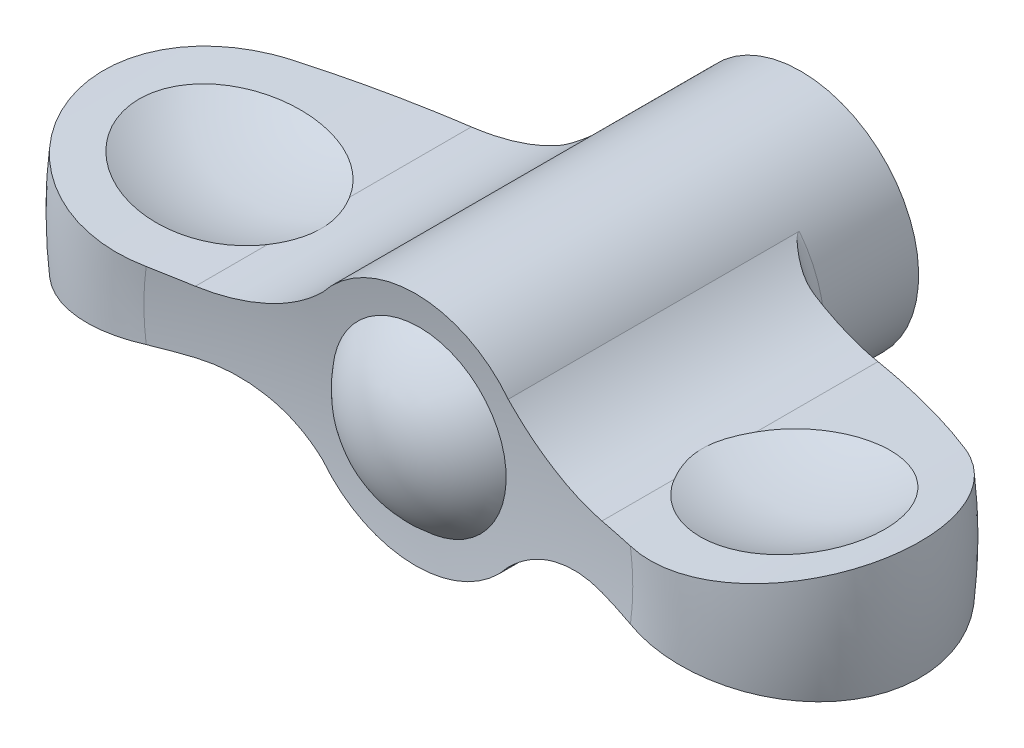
ISO-10303-21;
HEADER;
FILE_DESCRIPTION(('STEP AP214'),'2;1');
FILE_NAME('part.step','',(''),(''),'','','');
FILE_SCHEMA(('AUTOMOTIVE_DESIGN { 1 0 10303 214 1 1 1 1 }'));
ENDSEC;
DATA;
#1=APPLICATION_CONTEXT('core data for automotive mechanical design processes');
#2=APPLICATION_PROTOCOL_DEFINITION('international standard','automotive_design',2000,#1);
#3=PRODUCT_CONTEXT('',#1,'mechanical');
#4=PRODUCT('Part','Part','',(#3));
#5=PRODUCT_RELATED_PRODUCT_CATEGORY('part','',(#4));
#6=PRODUCT_DEFINITION_FORMATION('','',#4);
#7=PRODUCT_DEFINITION_CONTEXT('part definition',#1,'design');
#8=PRODUCT_DEFINITION('design','',#6,#7);
#9=PRODUCT_DEFINITION_SHAPE('','',#8);
#10=(LENGTH_UNIT() NAMED_UNIT(*) SI_UNIT(.MILLI.,.METRE.));
#11=(NAMED_UNIT(*) PLANE_ANGLE_UNIT() SI_UNIT($,.RADIAN.));
#12=(NAMED_UNIT(*) SI_UNIT($,.STERADIAN.) SOLID_ANGLE_UNIT());
#13=UNCERTAINTY_MEASURE_WITH_UNIT(LENGTH_MEASURE(1.E-05),#10,'distance_accuracy_value','');
#14=(GEOMETRIC_REPRESENTATION_CONTEXT(3) GLOBAL_UNCERTAINTY_ASSIGNED_CONTEXT((#13)) GLOBAL_UNIT_ASSIGNED_CONTEXT((#10,
#11,#12)) REPRESENTATION_CONTEXT('',''));
#15=CARTESIAN_POINT('',(0.,0.,0.));
#16=DIRECTION('',(0.,0.,1.));
#17=DIRECTION('',(1.,0.,0.));
#18=AXIS2_PLACEMENT_3D('',#15,#16,#17);
#19=CARTESIAN_POINT('',(0.,0.,8.));
#20=DIRECTION('',(0.,0.,-1.));
#21=DIRECTION('',(0.,1.,0.));
#22=AXIS2_PLACEMENT_3D('',#19,#20,#21);
#23=TOROIDAL_SURFACE('',#22,11.8,1.80000000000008);
#24=CARTESIAN_POINT('',(-10.936400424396,-3.94636818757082,9.7916319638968));
#25=CARTESIAN_POINT('',(-10.824118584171,-4.00370429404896,9.78325234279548));
#26=CARTESIAN_POINT('',(-10.7132133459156,-4.06254400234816,9.76897182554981));
#27=CARTESIAN_POINT('',(-10.4947965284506,-4.18269546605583,9.73031315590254));
#28=CARTESIAN_POINT('',(-10.3872790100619,-4.24400241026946,9.70595387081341));
#29=CARTESIAN_POINT('',(-10.1765147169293,-4.36838152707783,9.6489761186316));
#30=CARTESIAN_POINT('',(-10.0732455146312,-4.43144032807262,9.61641003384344));
#31=CARTESIAN_POINT('',(-9.87034998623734,-4.55941800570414,9.54423053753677));
#32=CARTESIAN_POINT('',(-9.77072514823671,-4.62433762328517,9.50461428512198));
#33=CARTESIAN_POINT('',(-9.55076497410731,-4.77218804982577,9.40879869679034));
#34=CARTESIAN_POINT('',(-9.43146470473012,-4.85557105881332,9.35092807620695));
#35=CARTESIAN_POINT('',(-9.19845422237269,-5.0245357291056,9.22749490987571));
#36=CARTESIAN_POINT('',(-9.08474708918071,-5.11011856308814,9.16192819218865));
#37=CARTESIAN_POINT('',(-8.89583509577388,-5.25740071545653,9.04459290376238));
#38=CARTESIAN_POINT('',(-8.81922141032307,-5.31864764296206,8.99450670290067));
#39=CARTESIAN_POINT('',(-8.66877804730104,-5.44185241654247,8.89113944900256));
#40=CARTESIAN_POINT('',(-8.59494804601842,-5.50381017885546,8.83785876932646));
#41=CARTESIAN_POINT('',(-8.4741799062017,-5.60755853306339,8.74594898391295));
#42=CARTESIAN_POINT('',(-8.42641392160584,-5.64925103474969,8.7082931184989));
#43=CARTESIAN_POINT('',(-8.33242521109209,-5.73256077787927,8.6310972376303));
#44=CARTESIAN_POINT('',(-8.28620142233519,-5.77417805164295,8.59155856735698));
#45=CARTESIAN_POINT('',(-8.21125367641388,-5.84266935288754,8.52388347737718));
#46=CARTESIAN_POINT('',(-8.18198002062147,-5.86968993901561,8.49650386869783));
#47=CARTESIAN_POINT('',(-8.12444979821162,-5.92330159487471,8.44010631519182));
#48=CARTESIAN_POINT('',(-8.09619524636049,-5.94989176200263,8.41108538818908));
#49=CARTESIAN_POINT('',(-8.04234032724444,-6.00103726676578,8.35179046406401));
#50=CARTESIAN_POINT('',(-8.01668026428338,-6.02563150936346,8.32160361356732));
#51=CARTESIAN_POINT('',(-7.96790958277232,-6.07276025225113,8.2576023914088));
#52=CARTESIAN_POINT('',(-7.94479257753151,-6.09529988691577,8.22379754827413));
#53=CARTESIAN_POINT('',(-7.91701322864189,-6.12255630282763,8.17250880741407));
#54=CARTESIAN_POINT('',(-7.90975258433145,-6.12970126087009,8.157793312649));
#55=CARTESIAN_POINT('',(-7.89665438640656,-6.14261741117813,8.12727584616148));
#56=CARTESIAN_POINT('',(-7.89080740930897,-6.14839769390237,8.11148202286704));
#57=CARTESIAN_POINT('',(-7.88158226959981,-6.15753000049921,8.08013275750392));
#58=CARTESIAN_POINT('',(-7.87802903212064,-6.16105398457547,8.06468423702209));
#59=CARTESIAN_POINT('',(-7.87307566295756,-6.16597001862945,8.03281428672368));
#60=CARTESIAN_POINT('',(-7.87172008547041,-6.16731795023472,8.01637956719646));
#61=CARTESIAN_POINT('',(-7.8717856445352,-6.16725149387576,7.9998));
#62=B_SPLINE_CURVE_WITH_KNOTS('',3,(#24,#25,#26,#27,#28,#29,#30,#31,#32,#33,#34,#35,#36,#37,#38,
#39,#40,#41,#42,#43,#44,#45,#46,#47,#48,#49,#50,#51,#52,#53,#54,#55,#56,#57,#58,#59,#60,#61),
.UNSPECIFIED.,.F.,.F.,(4,2,2,2,2,2,2,2,2,2,2,2,2,2,2,2,2,2,4),(0.,0.378686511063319,
0.756667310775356,1.13229407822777,1.50807255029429,1.97761636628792,2.44741590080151,
2.77774393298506,3.10803343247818,3.32923096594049,3.55027276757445,3.6952714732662,
3.84054267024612,3.98039395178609,4.11988557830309,4.17347981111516,4.22670627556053,
4.27513325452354,4.32453026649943),.UNSPECIFIED.);
#63=CARTESIAN_POINT('',(-10.9337221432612,-3.94773654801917,9.7914319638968));
#64=VERTEX_POINT('',#63);
#65=CARTESIAN_POINT('',(-7.8717855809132,-6.16725155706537,8.));
#66=VERTEX_POINT('',#65);
#67=EDGE_CURVE('E487',#64,#66,#62,.T.);
#68=ORIENTED_EDGE('',*,*,#67,.F.);
#69=CARTESIAN_POINT('',(0.,0.,9.7914319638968));
#70=DIRECTION('',(0.,0.,-1.));
#71=DIRECTION('',(0.,1.,0.));
#72=AXIS2_PLACEMENT_3D('',#69,#70,#71);
#73=CIRCLE('',#72,11.6245818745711);
#74=CARTESIAN_POINT('',(-10.9337221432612,3.94773654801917,9.7914319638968));
#75=VERTEX_POINT('',#74);
#76=EDGE_CURVE('E500',#64,#75,#73,.T.);
#77=ORIENTED_EDGE('',*,*,#76,.T.);
#78=CARTESIAN_POINT('',(-10.936400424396,3.94636818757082,9.7916319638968));
#79=CARTESIAN_POINT('',(-10.824118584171,4.00370429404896,9.78325234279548));
#80=CARTESIAN_POINT('',(-10.7132133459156,4.06254400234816,9.76897182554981));
#81=CARTESIAN_POINT('',(-10.4947965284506,4.18269546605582,9.73031315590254));
#82=CARTESIAN_POINT('',(-10.3872790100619,4.24400241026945,9.70595387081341));
#83=CARTESIAN_POINT('',(-10.1765147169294,4.36838152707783,9.64897611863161));
#84=CARTESIAN_POINT('',(-10.0732455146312,4.43144032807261,9.61641003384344));
#85=CARTESIAN_POINT('',(-9.87034998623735,4.55941800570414,9.54423053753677));
#86=CARTESIAN_POINT('',(-9.77072514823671,4.62433762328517,9.50461428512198));
#87=CARTESIAN_POINT('',(-9.55076497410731,4.77218804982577,9.40879869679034));
#88=CARTESIAN_POINT('',(-9.43146470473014,4.85557105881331,9.35092807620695));
#89=CARTESIAN_POINT('',(-9.1984542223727,5.02453572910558,9.22749490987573));
#90=CARTESIAN_POINT('',(-9.0847470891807,5.11011856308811,9.1619281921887));
#91=CARTESIAN_POINT('',(-8.89583509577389,5.25740071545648,9.04459290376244));
#92=CARTESIAN_POINT('',(-8.8192214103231,5.318647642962,8.99450670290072));
#93=CARTESIAN_POINT('',(-8.66877804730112,5.44185241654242,8.89113944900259));
#94=CARTESIAN_POINT('',(-8.59494804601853,5.50381017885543,8.8378587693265));
#95=CARTESIAN_POINT('',(-8.47417990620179,5.60755853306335,8.74594898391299));
#96=CARTESIAN_POINT('',(-8.4264139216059,5.64925103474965,8.70829311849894));
#97=CARTESIAN_POINT('',(-8.33242521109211,5.73256077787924,8.63109723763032));
#98=CARTESIAN_POINT('',(-8.2862014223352,5.77417805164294,8.59155856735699));
#99=CARTESIAN_POINT('',(-8.21125367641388,5.84266935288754,8.52388347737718));
#100=CARTESIAN_POINT('',(-8.18198002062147,5.86968993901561,8.49650386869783));
#101=CARTESIAN_POINT('',(-8.12444979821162,5.92330159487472,8.44010631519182));
#102=CARTESIAN_POINT('',(-8.09619524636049,5.94989176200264,8.41108538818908));
#103=CARTESIAN_POINT('',(-8.04234032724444,6.00103726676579,8.35179046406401));
#104=CARTESIAN_POINT('',(-8.01668026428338,6.02563150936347,8.32160361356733));
#105=CARTESIAN_POINT('',(-7.96790958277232,6.07276025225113,8.2576023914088));
#106=CARTESIAN_POINT('',(-7.94479257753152,6.09529988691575,8.22379754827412));
#107=CARTESIAN_POINT('',(-7.91701322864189,6.12255630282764,8.17250880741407));
#108=CARTESIAN_POINT('',(-7.90975258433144,6.1297012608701,8.15779331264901));
#109=CARTESIAN_POINT('',(-7.89665438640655,6.14261741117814,8.12727584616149));
#110=CARTESIAN_POINT('',(-7.89080740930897,6.14839769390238,8.11148202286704));
#111=CARTESIAN_POINT('',(-7.88158226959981,6.1575300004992,8.08013275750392));
#112=CARTESIAN_POINT('',(-7.87802903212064,6.16105398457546,8.06468423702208));
#113=CARTESIAN_POINT('',(-7.87307566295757,6.16597001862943,8.03281428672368));
#114=CARTESIAN_POINT('',(-7.87172008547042,6.16731795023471,8.01637956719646));
#115=CARTESIAN_POINT('',(-7.8717856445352,6.16725149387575,7.9998));
#116=B_SPLINE_CURVE_WITH_KNOTS('',3,(#78,#79,#80,#81,#82,#83,#84,#85,#86,#87,#88,#89,#90,#91,
#92,#93,#94,#95,#96,#97,#98,#99,#100,#101,#102,#103,#104,#105,#106,#107,#108,#109,#110,#111,
#112,#113,#114,#115),.UNSPECIFIED.,.F.,.F.,(4,2,2,2,2,2,2,2,2,2,2,2,2,2,2,2,2,2,4),(0.,
0.378686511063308,0.756667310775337,1.13229407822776,1.50807255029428,1.97761636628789,
2.44741590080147,2.77774393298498,3.10803343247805,3.32923096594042,3.55027276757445,
3.6952714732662,3.84054267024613,3.98039395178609,4.11988557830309,4.17347981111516,
4.22670627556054,4.27513325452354,4.32453026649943),.UNSPECIFIED.);
#117=CARTESIAN_POINT('',(-7.8717855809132,6.16725155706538,8.));
#118=VERTEX_POINT('',#117);
#119=EDGE_CURVE('E318',#75,#118,#116,.T.);
#120=ORIENTED_EDGE('',*,*,#119,.T.);
#121=CARTESIAN_POINT('',(0.,0.,8.));
#122=DIRECTION('',(0.,0.,-1.));
#123=DIRECTION('',(0.,1.,0.));
#124=AXIS2_PLACEMENT_3D('',#121,#122,#123);
#125=CIRCLE('',#124,10.);
#126=EDGE_CURVE('E437',#66,#118,#125,.T.);
#127=ORIENTED_EDGE('',*,*,#126,.F.);
#128=EDGE_LOOP('',(#68,#77,#120,#127));
#129=FACE_BOUND('',#128,.T.);
#130=ADVANCED_FACE('F14',(#129),#23,.F.);
#131=CARTESIAN_POINT('',(0.,0.,60.3122983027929));
#132=DIRECTION('',(0.,0.,-1.));
#133=DIRECTION('',(0.,1.,0.));
#134=AXIS2_PLACEMENT_3D('',#131,#132,#133);
#135=DEGENERATE_TOROIDAL_SURFACE('',#134,6.6775474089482,50.7624968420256,.T.);
#136=ORIENTED_EDGE('',*,*,#76,.F.);
#137=CARTESIAN_POINT('',(-6.5467060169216,-7.72330133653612,9.66697769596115));
#138=CARTESIAN_POINT('',(-6.64591288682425,-7.58492422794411,9.66416255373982));
#139=CARTESIAN_POINT('',(-6.74799440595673,-7.44862247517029,9.661900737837));
#140=CARTESIAN_POINT('',(-6.95774811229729,-7.18037757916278,9.65844214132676));
#141=CARTESIAN_POINT('',(-7.06542027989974,-7.04843442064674,9.6572453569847));
#142=CARTESIAN_POINT('',(-7.39653737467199,-6.6595102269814,9.65519040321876));
#143=CARTESIAN_POINT('',(-7.62812663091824,-6.40937348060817,9.65586643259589));
#144=CARTESIAN_POINT('',(-8.11129299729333,-5.92925394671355,9.66138002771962));
#145=CARTESIAN_POINT('',(-8.36287299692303,-5.69927408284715,9.66621819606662));
#146=CARTESIAN_POINT('',(-8.88421895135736,-5.26109545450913,9.68055080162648));
#147=CARTESIAN_POINT('',(-9.15398440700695,-5.05289609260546,9.69004511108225));
#148=CARTESIAN_POINT('',(-9.70731186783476,-4.66146851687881,9.71434109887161));
#149=CARTESIAN_POINT('',(-9.99073342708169,-4.47803881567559,9.72909588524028));
#150=CARTESIAN_POINT('',(-10.5714417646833,-4.13530031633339,9.76473262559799));
#151=CARTESIAN_POINT('',(-10.8687285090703,-3.97599145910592,9.78561456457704));
#152=CARTESIAN_POINT('',(-11.4746831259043,-3.68269992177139,9.83420440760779));
#153=CARTESIAN_POINT('',(-11.7833407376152,-3.54869504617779,9.86190627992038));
#154=CARTESIAN_POINT('',(-12.4099583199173,-3.30668939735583,9.92468529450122));
#155=CARTESIAN_POINT('',(-12.72791823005,-3.19868845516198,9.95976238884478));
#156=CARTESIAN_POINT('',(-13.3702784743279,-3.00943594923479,10.0375625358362));
#157=CARTESIAN_POINT('',(-13.694668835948,-2.92814595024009,10.080274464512));
#158=CARTESIAN_POINT('',(-14.3479208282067,-2.7924555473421,10.173495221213));
#159=CARTESIAN_POINT('',(-14.6767824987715,-2.73805538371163,10.2240041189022));
#160=CARTESIAN_POINT('',(-15.3369192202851,-2.65620760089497,10.3328061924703));
#161=CARTESIAN_POINT('',(-15.6681964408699,-2.62878831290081,10.3911074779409));
#162=CARTESIAN_POINT('',(-16.3304789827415,-2.60086726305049,10.5152293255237));
#163=CARTESIAN_POINT('',(-16.6614842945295,-2.60036640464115,10.5810501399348));
#164=CARTESIAN_POINT('',(-17.3240428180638,-2.62605289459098,10.7205107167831));
#165=CARTESIAN_POINT('',(-17.6555720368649,-2.65249066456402,10.7942180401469));
#166=CARTESIAN_POINT('',(-18.3138495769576,-2.73187573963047,10.9484805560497));
#167=CARTESIAN_POINT('',(-18.6405974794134,-2.78482535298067,11.0290363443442));
#168=CARTESIAN_POINT('',(-19.2867879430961,-2.91642655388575,11.1963521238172));
#169=CARTESIAN_POINT('',(-19.6062391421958,-2.99504586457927,11.2831042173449));
#170=CARTESIAN_POINT('',(-20.2362844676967,-3.17708996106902,11.4622866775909));
#171=CARTESIAN_POINT('',(-20.5468805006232,-3.28050936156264,11.5547158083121));
#172=CARTESIAN_POINT('',(-20.8521318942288,-3.39588894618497,11.6496949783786));
#173=B_SPLINE_CURVE_WITH_KNOTS('',3,(#137,#138,#139,#140,#141,#142,#143,#144,#145,#146,#147,
#148,#149,#150,#151,#152,#153,#154,#155,#156,#157,#158,#159,#160,#161,#162,#163,#164,#165,#166,
#167,#168,#169,#170,#171,#172),.UNSPECIFIED.,.F.,.F.,(4,2,2,2,2,2,2,2,2,2,2,2,2,2,2,2,2,4),(0.,
0.510785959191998,1.02157012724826,2.04291399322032,3.06440575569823,4.08586949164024,
5.09844663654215,6.11102130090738,7.12270361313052,8.13437935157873,9.14459291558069,
10.1548155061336,11.1660977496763,12.1774139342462,13.1982178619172,14.2191106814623,
15.2387247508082,16.2581176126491),.UNSPECIFIED.);
#174=CARTESIAN_POINT('',(-17.2513916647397,-2.62600423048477,10.7060191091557));
#175=VERTEX_POINT('',#174);
#176=EDGE_CURVE('E481',#64,#175,#173,.T.);
#177=ORIENTED_EDGE('',*,*,#176,.T.);
#178=CARTESIAN_POINT('',(-28.5420587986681,-3.86093353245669,14.6248916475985));
#179=CARTESIAN_POINT('',(-28.0949251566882,-3.78973654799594,14.4056959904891));
#180=CARTESIAN_POINT('',(-27.6441940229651,-3.72065339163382,14.1932196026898));
#181=CARTESIAN_POINT('',(-26.7359054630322,-3.58698745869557,13.7818878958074));
#182=CARTESIAN_POINT('',(-26.2783480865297,-3.52240464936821,13.583032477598));
#183=CARTESIAN_POINT('',(-24.8998297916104,-3.33633398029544,13.0087706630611));
#184=CARTESIAN_POINT('',(-23.9692804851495,-3.22192463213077,12.6538347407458));
#185=CARTESIAN_POINT('',(-22.0863023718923,-3.01405683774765,12.0002442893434));
#186=CARTESIAN_POINT('',(-21.133873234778,-2.92059870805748,11.701590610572));
#187=CARTESIAN_POINT('',(-19.6898454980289,-2.79722984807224,11.296179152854));
#188=CARTESIAN_POINT('',(-19.2049108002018,-2.75884755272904,11.1679139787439));
#189=CARTESIAN_POINT('',(-18.2309836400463,-2.68796520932,10.9259763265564));
#190=CARTESIAN_POINT('',(-17.7419911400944,-2.65546521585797,10.8123039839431));
#191=CARTESIAN_POINT('',(-17.2511916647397,-2.6259922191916,10.7059757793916));
#192=B_SPLINE_CURVE_WITH_KNOTS('',3,(#178,#179,#180,#181,#182,#183,#184,#185,#186,#187,#188,
#189,#190,#191),.UNSPECIFIED.,.F.,.F.,(4,2,2,2,2,2,4),(0.,1.50898291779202,3.01795485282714,
6.0232908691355,9.02867228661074,10.5376740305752,12.0466897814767),.UNSPECIFIED.);
#193=CARTESIAN_POINT('',(-28.5416508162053,-3.86086857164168,14.6246916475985));
#194=VERTEX_POINT('',#193);
#195=EDGE_CURVE('E511',#194,#175,#192,.T.);
#196=ORIENTED_EDGE('',*,*,#195,.F.);
#197=CARTESIAN_POINT('',(0.,0.,14.6246916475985));
#198=DIRECTION('',(0.,0.,-1.));
#199=DIRECTION('',(0.,1.,0.));
#200=AXIS2_PLACEMENT_3D('',#197,#198,#199);
#201=CIRCLE('',#200,28.8015995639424);
#202=CARTESIAN_POINT('',(-28.5416508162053,3.86086857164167,14.6246916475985));
#203=VERTEX_POINT('',#202);
#204=EDGE_CURVE('E498',#194,#203,#201,.T.);
#205=ORIENTED_EDGE('',*,*,#204,.T.);
#206=CARTESIAN_POINT('',(-28.542058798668,3.86093353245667,14.6248916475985));
#207=CARTESIAN_POINT('',(-28.0949251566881,3.78973654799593,14.4056959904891));
#208=CARTESIAN_POINT('',(-27.644194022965,3.7206533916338,14.1932196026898));
#209=CARTESIAN_POINT('',(-26.7359054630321,3.58698745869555,13.7818878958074));
#210=CARTESIAN_POINT('',(-26.2783480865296,3.52240464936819,13.583032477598));
#211=CARTESIAN_POINT('',(-24.8998297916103,3.33633398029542,13.0087706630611));
#212=CARTESIAN_POINT('',(-23.9692804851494,3.22192463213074,12.6538347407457));
#213=CARTESIAN_POINT('',(-22.0863023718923,3.01405683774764,12.0002442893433));
#214=CARTESIAN_POINT('',(-21.133873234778,2.92059870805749,11.701590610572));
#215=CARTESIAN_POINT('',(-19.6898454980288,2.79722984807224,11.296179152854));
#216=CARTESIAN_POINT('',(-19.2049108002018,2.75884755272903,11.1679139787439));
#217=CARTESIAN_POINT('',(-18.2309836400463,2.68796520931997,10.9259763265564));
#218=CARTESIAN_POINT('',(-17.7419911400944,2.65546521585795,10.8123039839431));
#219=CARTESIAN_POINT('',(-17.2511916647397,2.6259922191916,10.7059757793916));
#220=B_SPLINE_CURVE_WITH_KNOTS('',3,(#206,#207,#208,#209,#210,#211,#212,#213,#214,#215,#216,
#217,#218,#219),.UNSPECIFIED.,.F.,.F.,(4,2,2,2,2,2,4),(0.,1.50898291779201,3.01795485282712,
6.02329086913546,9.02867228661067,10.5376740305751,12.0466897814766),.UNSPECIFIED.);
#221=CARTESIAN_POINT('',(-17.2513916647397,2.62600423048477,10.7060191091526));
#222=VERTEX_POINT('',#221);
#223=EDGE_CURVE('E332',#203,#222,#220,.T.);
#224=ORIENTED_EDGE('',*,*,#223,.T.);
#225=CARTESIAN_POINT('',(-6.5467060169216,7.72330133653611,9.66697769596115));
#226=CARTESIAN_POINT('',(-6.64591288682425,7.5849242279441,9.66416255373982));
#227=CARTESIAN_POINT('',(-6.74799440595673,7.44862247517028,9.661900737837));
#228=CARTESIAN_POINT('',(-6.9577481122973,7.18037757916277,9.65844214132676));
#229=CARTESIAN_POINT('',(-7.06542027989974,7.04843442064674,9.6572453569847));
#230=CARTESIAN_POINT('',(-7.39653737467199,6.65951022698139,9.65519040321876));
#231=CARTESIAN_POINT('',(-7.62812663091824,6.40937348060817,9.65586643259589));
#232=CARTESIAN_POINT('',(-8.11129299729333,5.92925394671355,9.66138002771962));
#233=CARTESIAN_POINT('',(-8.36287299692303,5.69927408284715,9.66621819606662));
#234=CARTESIAN_POINT('',(-8.88421895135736,5.26109545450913,9.68055080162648));
#235=CARTESIAN_POINT('',(-9.15398440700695,5.05289609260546,9.69004511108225));
#236=CARTESIAN_POINT('',(-9.70731186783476,4.66146851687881,9.71434109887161));
#237=CARTESIAN_POINT('',(-9.99073342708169,4.47803881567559,9.72909588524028));
#238=CARTESIAN_POINT('',(-10.5714417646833,4.13530031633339,9.76473262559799));
#239=CARTESIAN_POINT('',(-10.8687285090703,3.97599145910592,9.78561456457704));
#240=CARTESIAN_POINT('',(-11.4746831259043,3.68269992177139,9.83420440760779));
#241=CARTESIAN_POINT('',(-11.7833407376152,3.54869504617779,9.86190627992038));
#242=CARTESIAN_POINT('',(-12.4099583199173,3.30668939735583,9.92468529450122));
#243=CARTESIAN_POINT('',(-12.72791823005,3.19868845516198,9.95976238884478));
#244=CARTESIAN_POINT('',(-13.3702784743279,3.00943594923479,10.0375625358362));
#245=CARTESIAN_POINT('',(-13.694668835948,2.92814595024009,10.080274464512));
#246=CARTESIAN_POINT('',(-14.3479208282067,2.7924555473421,10.173495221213));
#247=CARTESIAN_POINT('',(-14.6767824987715,2.73805538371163,10.2240041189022));
#248=CARTESIAN_POINT('',(-15.3369192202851,2.65620760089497,10.3328061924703));
#249=CARTESIAN_POINT('',(-15.6681964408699,2.62878831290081,10.3911074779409));
#250=CARTESIAN_POINT('',(-16.3304789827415,2.60086726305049,10.5152293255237));
#251=CARTESIAN_POINT('',(-16.6614842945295,2.60036640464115,10.5810501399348));
#252=CARTESIAN_POINT('',(-17.3240428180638,2.62605289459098,10.7205107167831));
#253=CARTESIAN_POINT('',(-17.6555720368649,2.65249066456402,10.7942180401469));
#254=CARTESIAN_POINT('',(-18.3138495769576,2.73187573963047,10.9484805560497));
#255=CARTESIAN_POINT('',(-18.6405974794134,2.78482535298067,11.0290363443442));
#256=CARTESIAN_POINT('',(-19.2867879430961,2.91642655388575,11.1963521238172));
#257=CARTESIAN_POINT('',(-19.6062391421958,2.99504586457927,11.2831042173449));
#258=CARTESIAN_POINT('',(-20.2362844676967,3.17708996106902,11.4622866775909));
#259=CARTESIAN_POINT('',(-20.5468805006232,3.28050936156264,11.5547158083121));
#260=CARTESIAN_POINT('',(-20.8521318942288,3.39588894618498,11.6496949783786));
#261=B_SPLINE_CURVE_WITH_KNOTS('',3,(#225,#226,#227,#228,#229,#230,#231,#232,#233,#234,#235,
#236,#237,#238,#239,#240,#241,#242,#243,#244,#245,#246,#247,#248,#249,#250,#251,#252,#253,#254,
#255,#256,#257,#258,#259,#260),.UNSPECIFIED.,.F.,.F.,(4,2,2,2,2,2,2,2,2,2,2,2,2,2,2,2,2,4),(0.,
0.510785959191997,1.02157012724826,2.04291399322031,3.06440575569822,4.08586949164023,
5.09844663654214,6.11102130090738,7.12270361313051,8.13437935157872,9.14459291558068,
10.1548155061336,11.1660977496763,12.1774139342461,13.1982178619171,14.2191106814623,
15.2387247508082,16.2581176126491),.UNSPECIFIED.);
#262=EDGE_CURVE('E301',#75,#222,#261,.T.);
#263=ORIENTED_EDGE('',*,*,#262,.F.);
#264=EDGE_LOOP('',(#136,#177,#196,#205,#224,#263));
#265=FACE_BOUND('',#264,.T.);
#266=ADVANCED_FACE('F508',(#265),#135,.T.);
#267=CARTESIAN_POINT('',(0.,0.,24.5131504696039));
#268=DIRECTION('',(0.,0.,-1.));
#269=DIRECTION('',(0.,1.,0.));
#270=AXIS2_PLACEMENT_3D('',#267,#268,#269);
#271=TOROIDAL_SURFACE('',#270,24.0131504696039,10.9868495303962);
#272=CARTESIAN_POINT('',(-17.2511916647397,-2.62599221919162,33.3242100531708));
#273=CARTESIAN_POINT('',(-17.4993781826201,-2.64089075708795,33.5086851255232));
#274=CARTESIAN_POINT('',(-17.7552628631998,-2.65706460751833,33.6826969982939));
#275=CARTESIAN_POINT('',(-18.28053769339,-2.69210530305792,34.0086627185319));
#276=CARTESIAN_POINT('',(-18.5499277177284,-2.71097212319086,34.1606167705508));
#277=CARTESIAN_POINT('',(-19.1002002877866,-2.75153205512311,34.4412740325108));
#278=CARTESIAN_POINT('',(-19.381077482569,-2.77322386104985,34.5699879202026));
#279=CARTESIAN_POINT('',(-19.952432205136,-2.81952002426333,34.8033129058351));
#280=CARTESIAN_POINT('',(-20.2429095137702,-2.84412431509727,34.9079245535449));
#281=CARTESIAN_POINT('',(-20.8315983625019,-2.89628797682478,35.0923323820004));
#282=CARTESIAN_POINT('',(-21.1298150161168,-2.92384934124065,35.1721116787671));
#283=CARTESIAN_POINT('',(-21.7316508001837,-2.98187199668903,35.3061577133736));
#284=CARTESIAN_POINT('',(-22.035269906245,-3.01233327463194,35.3604245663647));
#285=CARTESIAN_POINT('',(-22.6456357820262,-3.0760359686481,35.4430189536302));
#286=CARTESIAN_POINT('',(-22.9523815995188,-3.10927655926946,35.4713541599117));
#287=CARTESIAN_POINT('',(-23.566877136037,-3.17836345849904,35.501889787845));
#288=CARTESIAN_POINT('',(-23.874626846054,-3.21420974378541,35.504090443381));
#289=CARTESIAN_POINT('',(-24.4874432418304,-3.28807700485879,35.4823817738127));
#290=CARTESIAN_POINT('',(-24.7925157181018,-3.32608674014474,35.4585974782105));
#291=CARTESIAN_POINT('',(-25.3992908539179,-3.404117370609,35.3852808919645));
#292=CARTESIAN_POINT('',(-25.7009935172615,-3.44413826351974,35.3357486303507));
#293=CARTESIAN_POINT('',(-26.2989412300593,-3.52581537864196,35.211278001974));
#294=CARTESIAN_POINT('',(-26.595185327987,-3.56747188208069,35.1363352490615));
#295=CARTESIAN_POINT('',(-27.1800717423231,-3.65197221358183,34.9615826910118));
#296=CARTESIAN_POINT('',(-27.4687140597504,-3.69481604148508,34.8617728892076));
#297=CARTESIAN_POINT('',(-28.035952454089,-3.78113479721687,34.6381665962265));
#298=CARTESIAN_POINT('',(-28.3145627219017,-3.82460870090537,34.514405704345));
#299=CARTESIAN_POINT('',(-28.8602471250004,-3.9117173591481,34.2436848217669));
#300=CARTESIAN_POINT('',(-29.1273212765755,-3.9553521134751,34.0967248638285));
#301=CARTESIAN_POINT('',(-29.6480727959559,-4.04221651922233,33.7806574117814));
#302=CARTESIAN_POINT('',(-29.9017509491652,-4.08544619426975,33.6115512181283));
#303=CARTESIAN_POINT('',(-30.3939845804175,-4.17091924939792,33.2523788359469));
#304=CARTESIAN_POINT('',(-30.6325400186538,-4.21316262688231,33.0623125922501));
#305=CARTESIAN_POINT('',(-31.0935716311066,-4.29619199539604,32.6619711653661));
#306=CARTESIAN_POINT('',(-31.3159985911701,-4.33697334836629,32.4516383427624));
#307=CARTESIAN_POINT('',(-31.7424740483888,-4.41635307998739,32.0127202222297));
#308=CARTESIAN_POINT('',(-31.9465225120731,-4.45495145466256,31.7841348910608));
#309=CARTESIAN_POINT('',(-32.3348520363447,-4.5293877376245,31.3103146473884));
#310=CARTESIAN_POINT('',(-32.5191323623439,-4.56522554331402,31.0650791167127));
#311=CARTESIAN_POINT('',(-32.8666572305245,-4.63358841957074,30.5596945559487));
#312=CARTESIAN_POINT('',(-33.0299017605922,-4.66611348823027,30.2995455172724));
#313=CARTESIAN_POINT('',(-33.3345075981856,-4.72739462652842,29.7656976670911));
#314=CARTESIAN_POINT('',(-33.4758297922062,-4.75614394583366,29.4919757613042));
#315=CARTESIAN_POINT('',(-33.7352733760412,-4.80934524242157,28.9333467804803));
#316=CARTESIAN_POINT('',(-33.8533947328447,-4.83379721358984,28.6484396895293));
#317=CARTESIAN_POINT('',(-34.0656204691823,-4.87800530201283,28.0694731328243));
#318=CARTESIAN_POINT('',(-34.1597255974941,-4.89776156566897,27.7754139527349));
#319=CARTESIAN_POINT('',(-34.3232748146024,-4.93225390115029,27.180228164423));
#320=CARTESIAN_POINT('',(-34.3927189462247,-4.94698998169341,26.8791015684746));
#321=CARTESIAN_POINT('',(-34.5063857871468,-4.97117989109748,26.2723608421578));
#322=CARTESIAN_POINT('',(-34.5506442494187,-4.98064120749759,25.96675370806));
#323=CARTESIAN_POINT('',(-34.6137870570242,-4.99415603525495,25.3528106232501));
#324=CARTESIAN_POINT('',(-34.6326714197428,-4.99820955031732,25.0444746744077));
#325=CARTESIAN_POINT('',(-34.644935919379,-5.00084099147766,24.4272603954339));
#326=CARTESIAN_POINT('',(-34.6383150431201,-4.99941870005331,24.1183820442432));
#327=CARTESIAN_POINT('',(-34.5996125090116,-4.9911218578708,23.5022985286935));
#328=CARTESIAN_POINT('',(-34.5675308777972,-4.9842473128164,23.1950933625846));
#329=CARTESIAN_POINT('',(-34.4781950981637,-4.96517513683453,22.5850017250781));
#330=CARTESIAN_POINT('',(-34.4209785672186,-4.95298546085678,22.2821094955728));
#331=CARTESIAN_POINT('',(-34.2817747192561,-4.92348679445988,21.6823260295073));
#332=CARTESIAN_POINT('',(-34.1997873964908,-4.90617780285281,21.3854347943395));
#333=CARTESIAN_POINT('',(-34.0116119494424,-4.86672680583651,20.799780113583));
#334=CARTESIAN_POINT('',(-33.9054257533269,-4.84458518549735,20.5110160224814));
#335=CARTESIAN_POINT('',(-33.6695763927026,-4.79582854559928,19.9436331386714));
#336=CARTESIAN_POINT('',(-33.5399133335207,-4.76921354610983,19.6650143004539));
#337=CARTESIAN_POINT('',(-33.2578321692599,-4.71190410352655,19.1195687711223));
#338=CARTESIAN_POINT('',(-33.1053878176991,-4.68120495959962,18.8527561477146));
#339=CARTESIAN_POINT('',(-32.7788934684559,-4.61623623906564,18.3331441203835));
#340=CARTESIAN_POINT('',(-32.6048429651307,-4.58196657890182,18.0803450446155));
#341=CARTESIAN_POINT('',(-32.2363296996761,-4.51038975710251,17.5905487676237));
#342=CARTESIAN_POINT('',(-32.0418667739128,-4.47308257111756,17.3535516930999));
#343=CARTESIAN_POINT('',(-31.633867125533,-4.39599896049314,16.8970435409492));
#344=CARTESIAN_POINT('',(-31.4203320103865,-4.35622274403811,16.6775309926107));
#345=CARTESIAN_POINT('',(-31.0011481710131,-4.27945832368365,16.2816097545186));
#346=CARTESIAN_POINT('',(-30.797399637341,-4.24267293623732,16.103144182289));
#347=CARTESIAN_POINT('',(-30.377205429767,-4.16804353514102,15.7621159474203));
#348=CARTESIAN_POINT('',(-30.1607608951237,-4.13019961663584,15.5995518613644));
#349=CARTESIAN_POINT('',(-29.7163820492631,-4.05387450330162,15.2912603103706));
#350=CARTESIAN_POINT('',(-29.4884504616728,-4.01539346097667,15.1455288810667));
#351=CARTESIAN_POINT('',(-29.0222683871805,-3.9381829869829,14.871631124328));
#352=CARTESIAN_POINT('',(-28.7840165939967,-3.89945352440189,14.7434670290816));
#353=CARTESIAN_POINT('',(-28.5412428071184,-3.86080360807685,14.6244916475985));
#354=B_SPLINE_CURVE_WITH_KNOTS('',3,(#272,#273,#274,#275,#276,#277,#278,#279,#280,#281,#282,
#283,#284,#285,#286,#287,#288,#289,#290,#291,#292,#293,#294,#295,#296,#297,#298,#299,#300,#301,
#302,#303,#304,#305,#306,#307,#308,#309,#310,#311,#312,#313,#314,#315,#316,#317,#318,#319,#320,
#321,#322,#323,#324,#325,#326,#327,#328,#329,#330,#331,#332,#333,#334,#335,#336,#337,#338,#339,
#340,#341,#342,#343,#344,#345,#346,#347,#348,#349,#350,#351,#352,#353),.UNSPECIFIED.,.F.,.F.,(4,
2,2,2,2,2,2,2,2,2,2,2,2,2,2,2,2,2,2,2,2,2,2,2,2,2,2,2,2,2,2,2,2,2,2,2,2,2,2,2,4),(0.,
0.928513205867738,1.85701780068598,2.7850947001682,3.7131504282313,4.64183578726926,
5.57051695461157,6.49892327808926,7.42732129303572,8.35127181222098,9.27522128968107,
10.1993303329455,11.1234392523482,12.0461850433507,12.9689295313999,13.8916198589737,
14.8143126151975,15.7397117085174,16.6651124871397,17.5905476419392,18.5159833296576,
19.4430516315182,20.3701212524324,21.2971619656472,22.2242010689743,23.1499208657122,
24.0756400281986,25.0013959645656,25.9271509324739,26.8515250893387,27.7758994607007,
28.7002002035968,29.6244967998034,30.5498666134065,31.4752580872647,32.4006569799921,
33.3259779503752,34.1452666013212,34.9644818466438,35.7835037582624,36.6026296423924),.UNSPECIFIED.);
#355=CARTESIAN_POINT('',(-20.5453214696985,-2.87092129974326,35.0026521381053));
#356=VERTEX_POINT('',#355);
#357=EDGE_CURVE('E514',#356,#194,#354,.T.);
#358=ORIENTED_EDGE('',*,*,#357,.F.);
#359=CARTESIAN_POINT('',(0.,0.,35.0026521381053));
#360=DIRECTION('',(0.,0.,-1.));
#361=DIRECTION('',(0.,1.,0.));
#362=AXIS2_PLACEMENT_3D('',#359,#360,#361);
#363=CIRCLE('',#362,20.7449372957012);
#364=CARTESIAN_POINT('',(-20.5453214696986,2.87092129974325,35.0026521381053));
#365=VERTEX_POINT('',#364);
#366=EDGE_CURVE('E496',#356,#365,#363,.T.);
#367=ORIENTED_EDGE('',*,*,#366,.T.);
#368=CARTESIAN_POINT('',(-17.2511916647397,2.6259922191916,33.3242100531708));
#369=CARTESIAN_POINT('',(-17.4993781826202,2.64089075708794,33.5086851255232));
#370=CARTESIAN_POINT('',(-17.7552628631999,2.65706460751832,33.6826969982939));
#371=CARTESIAN_POINT('',(-18.28053769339,2.69210530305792,34.0086627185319));
#372=CARTESIAN_POINT('',(-18.5499277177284,2.71097212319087,34.1606167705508));
#373=CARTESIAN_POINT('',(-19.1002002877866,2.75153205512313,34.4412740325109));
#374=CARTESIAN_POINT('',(-19.3810774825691,2.77322386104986,34.5699879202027));
#375=CARTESIAN_POINT('',(-19.952432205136,2.81952002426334,34.8033129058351));
#376=CARTESIAN_POINT('',(-20.2429095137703,2.84412431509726,34.9079245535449));
#377=CARTESIAN_POINT('',(-20.831598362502,2.89628797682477,35.0923323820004));
#378=CARTESIAN_POINT('',(-21.1298150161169,2.92384934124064,35.1721116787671));
#379=CARTESIAN_POINT('',(-21.7316508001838,2.98187199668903,35.3061577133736));
#380=CARTESIAN_POINT('',(-22.0352699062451,3.01233327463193,35.3604245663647));
#381=CARTESIAN_POINT('',(-22.6456357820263,3.0760359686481,35.4430189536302));
#382=CARTESIAN_POINT('',(-22.9523815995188,3.10927655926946,35.4713541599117));
#383=CARTESIAN_POINT('',(-23.566877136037,3.17836345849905,35.501889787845));
#384=CARTESIAN_POINT('',(-23.874626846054,3.21420974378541,35.504090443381));
#385=CARTESIAN_POINT('',(-24.4874432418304,3.28807700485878,35.4823817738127));
#386=CARTESIAN_POINT('',(-24.7925157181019,3.32608674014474,35.4585974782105));
#387=CARTESIAN_POINT('',(-25.3992908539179,3.404117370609,35.3852808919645));
#388=CARTESIAN_POINT('',(-25.7009935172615,3.44413826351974,35.3357486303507));
#389=CARTESIAN_POINT('',(-26.2989412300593,3.52581537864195,35.211278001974));
#390=CARTESIAN_POINT('',(-26.595185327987,3.56747188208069,35.1363352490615));
#391=CARTESIAN_POINT('',(-27.1800717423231,3.65197221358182,34.9615826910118));
#392=CARTESIAN_POINT('',(-27.4687140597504,3.69481604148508,34.8617728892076));
#393=CARTESIAN_POINT('',(-28.035952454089,3.78113479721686,34.6381665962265));
#394=CARTESIAN_POINT('',(-28.3145627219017,3.82460870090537,34.514405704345));
#395=CARTESIAN_POINT('',(-28.8602471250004,3.9117173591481,34.2436848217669));
#396=CARTESIAN_POINT('',(-29.1273212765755,3.9553521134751,34.0967248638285));
#397=CARTESIAN_POINT('',(-29.6480727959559,4.04221651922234,33.7806574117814));
#398=CARTESIAN_POINT('',(-29.9017509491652,4.08544619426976,33.6115512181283));
#399=CARTESIAN_POINT('',(-30.3939845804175,4.17091924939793,33.2523788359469));
#400=CARTESIAN_POINT('',(-30.6325400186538,4.21316262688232,33.0623125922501));
#401=CARTESIAN_POINT('',(-31.0935716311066,4.29619199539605,32.6619711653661));
#402=CARTESIAN_POINT('',(-31.3159985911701,4.33697334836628,32.4516383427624));
#403=CARTESIAN_POINT('',(-31.7424740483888,4.41635307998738,32.0127202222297));
#404=CARTESIAN_POINT('',(-31.9465225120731,4.45495145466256,31.7841348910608));
#405=CARTESIAN_POINT('',(-32.3348520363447,4.52938773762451,31.3103146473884));
#406=CARTESIAN_POINT('',(-32.5191323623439,4.56522554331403,31.0650791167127));
#407=CARTESIAN_POINT('',(-32.8666572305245,4.63358841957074,30.5596945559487));
#408=CARTESIAN_POINT('',(-33.0299017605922,4.66611348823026,30.2995455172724));
#409=CARTESIAN_POINT('',(-33.3345075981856,4.72739462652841,29.7656976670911));
#410=CARTESIAN_POINT('',(-33.4758297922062,4.75614394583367,29.4919757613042));
#411=CARTESIAN_POINT('',(-33.7352733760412,4.80934524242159,28.9333467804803));
#412=CARTESIAN_POINT('',(-33.8533947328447,4.83379721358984,28.6484396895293));
#413=CARTESIAN_POINT('',(-34.0656204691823,4.87800530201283,28.0694731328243));
#414=CARTESIAN_POINT('',(-34.1597255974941,4.89776156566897,27.7754139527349));
#415=CARTESIAN_POINT('',(-34.3232748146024,4.93225390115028,27.180228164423));
#416=CARTESIAN_POINT('',(-34.3927189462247,4.9469899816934,26.8791015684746));
#417=CARTESIAN_POINT('',(-34.5063857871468,4.97117989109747,26.2723608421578));
#418=CARTESIAN_POINT('',(-34.5506442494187,4.9806412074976,25.96675370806));
#419=CARTESIAN_POINT('',(-34.6137870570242,4.99415603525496,25.3528106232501));
#420=CARTESIAN_POINT('',(-34.6326714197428,4.99820955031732,25.0444746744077));
#421=CARTESIAN_POINT('',(-34.644935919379,5.00084099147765,24.4272603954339));
#422=CARTESIAN_POINT('',(-34.6383150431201,4.9994187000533,24.1183820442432));
#423=CARTESIAN_POINT('',(-34.5996125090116,4.99112185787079,23.5022985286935));
#424=CARTESIAN_POINT('',(-34.5675308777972,4.98424731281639,23.1950933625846));
#425=CARTESIAN_POINT('',(-34.4781950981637,4.96517513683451,22.5850017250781));
#426=CARTESIAN_POINT('',(-34.4209785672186,4.95298546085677,22.2821094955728));
#427=CARTESIAN_POINT('',(-34.2817747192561,4.92348679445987,21.6823260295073));
#428=CARTESIAN_POINT('',(-34.1997873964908,4.90617780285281,21.3854347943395));
#429=CARTESIAN_POINT('',(-34.0116119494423,4.86672680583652,20.7997801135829));
#430=CARTESIAN_POINT('',(-33.9054257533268,4.84458518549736,20.5110160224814));
#431=CARTESIAN_POINT('',(-33.6695763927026,4.79582854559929,19.9436331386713));
#432=CARTESIAN_POINT('',(-33.5399133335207,4.76921354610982,19.6650143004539));
#433=CARTESIAN_POINT('',(-33.2578321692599,4.71190410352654,19.1195687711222));
#434=CARTESIAN_POINT('',(-33.1053878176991,4.68120495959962,18.8527561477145));
#435=CARTESIAN_POINT('',(-32.7788934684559,4.61623623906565,18.3331441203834));
#436=CARTESIAN_POINT('',(-32.6048429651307,4.58196657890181,18.0803450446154));
#437=CARTESIAN_POINT('',(-32.2363296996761,4.5103897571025,17.5905487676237));
#438=CARTESIAN_POINT('',(-32.0418667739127,4.47308257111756,17.3535516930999));
#439=CARTESIAN_POINT('',(-31.633867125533,4.39599896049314,16.8970435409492));
#440=CARTESIAN_POINT('',(-31.4203320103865,4.3562227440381,16.6775309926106));
#441=CARTESIAN_POINT('',(-31.0011481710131,4.27945832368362,16.2816097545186));
#442=CARTESIAN_POINT('',(-30.797399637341,4.2426729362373,16.103144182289));
#443=CARTESIAN_POINT('',(-30.377205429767,4.16804353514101,15.7621159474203));
#444=CARTESIAN_POINT('',(-30.1607608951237,4.13019961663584,15.5995518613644));
#445=CARTESIAN_POINT('',(-29.7163820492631,4.05387450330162,15.2912603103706));
#446=CARTESIAN_POINT('',(-29.4884504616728,4.01539346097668,15.1455288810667));
#447=CARTESIAN_POINT('',(-29.0222683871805,3.93818298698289,14.871631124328));
#448=CARTESIAN_POINT('',(-28.7840165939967,3.89945352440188,14.7434670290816));
#449=CARTESIAN_POINT('',(-28.5412428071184,3.86080360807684,14.6244916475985));
#450=B_SPLINE_CURVE_WITH_KNOTS('',3,(#368,#369,#370,#371,#372,#373,#374,#375,#376,#377,#378,
#379,#380,#381,#382,#383,#384,#385,#386,#387,#388,#389,#390,#391,#392,#393,#394,#395,#396,#397,
#398,#399,#400,#401,#402,#403,#404,#405,#406,#407,#408,#409,#410,#411,#412,#413,#414,#415,#416,
#417,#418,#419,#420,#421,#422,#423,#424,#425,#426,#427,#428,#429,#430,#431,#432,#433,#434,#435,
#436,#437,#438,#439,#440,#441,#442,#443,#444,#445,#446,#447,#448,#449),.UNSPECIFIED.,.F.,.F.,(4,
2,2,2,2,2,2,2,2,2,2,2,2,2,2,2,2,2,2,2,2,2,2,2,2,2,2,2,2,2,2,2,2,2,2,2,2,2,2,2,4),(0.,
0.92851320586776,1.85701780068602,2.78509470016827,3.7131504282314,4.64183578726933,
5.57051695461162,6.49892327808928,7.42732129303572,8.35127181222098,9.27522128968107,
10.1993303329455,11.1234392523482,12.0461850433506,12.9689295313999,13.8916198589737,
14.8143126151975,15.7397117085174,16.6651124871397,17.5905476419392,18.5159833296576,
19.4430516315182,20.3701212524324,21.2971619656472,22.2242010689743,23.1499208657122,
24.0756400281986,25.0013959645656,25.9271509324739,26.8515250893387,27.7758994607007,
28.7002002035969,29.6244967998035,30.5498666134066,31.4752580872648,32.4006569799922,
33.3259779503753,34.1452666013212,34.9644818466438,35.7835037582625,36.6026296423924),.UNSPECIFIED.);
#451=EDGE_CURVE('E325',#365,#203,#450,.T.);
#452=ORIENTED_EDGE('',*,*,#451,.T.);
#453=ORIENTED_EDGE('',*,*,#204,.F.);
#454=EDGE_LOOP('',(#358,#367,#452,#453));
#455=FACE_BOUND('',#454,.T.);
#456=ADVANCED_FACE('F338',(#455),#271,.T.);
#457=CARTESIAN_POINT('',(17.2511916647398,2.6259922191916,33.3242100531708));
#458=CARTESIAN_POINT('',(17.4993781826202,2.64089075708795,33.5086851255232));
#459=CARTESIAN_POINT('',(17.7552628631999,2.65706460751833,33.6826969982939));
#460=CARTESIAN_POINT('',(18.28053769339,2.69210530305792,34.0086627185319));
#461=CARTESIAN_POINT('',(18.5499277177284,2.71097212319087,34.1606167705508));
#462=CARTESIAN_POINT('',(19.1002002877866,2.75153205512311,34.4412740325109));
#463=CARTESIAN_POINT('',(19.3810774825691,2.77322386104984,34.5699879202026));
#464=CARTESIAN_POINT('',(19.952432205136,2.81952002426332,34.8033129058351));
#465=CARTESIAN_POINT('',(20.2429095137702,2.84412431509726,34.9079245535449));
#466=CARTESIAN_POINT('',(20.8315983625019,2.89628797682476,35.0923323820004));
#467=CARTESIAN_POINT('',(21.1298150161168,2.92384934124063,35.1721116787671));
#468=CARTESIAN_POINT('',(21.7316508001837,2.98187199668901,35.3061577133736));
#469=CARTESIAN_POINT('',(22.035269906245,3.01233327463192,35.3604245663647));
#470=CARTESIAN_POINT('',(22.6456357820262,3.07603596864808,35.4430189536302));
#471=CARTESIAN_POINT('',(22.9523815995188,3.10927655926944,35.4713541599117));
#472=CARTESIAN_POINT('',(23.566877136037,3.17836345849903,35.501889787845));
#473=CARTESIAN_POINT('',(23.874626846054,3.21420974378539,35.504090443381));
#474=CARTESIAN_POINT('',(24.4874432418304,3.28807700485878,35.4823817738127));
#475=CARTESIAN_POINT('',(24.7925157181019,3.32608674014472,35.4585974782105));
#476=CARTESIAN_POINT('',(25.3992908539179,3.40411737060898,35.3852808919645));
#477=CARTESIAN_POINT('',(25.7009935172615,3.44413826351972,35.3357486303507));
#478=CARTESIAN_POINT('',(26.2989412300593,3.52581537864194,35.211278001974));
#479=CARTESIAN_POINT('',(26.595185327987,3.56747188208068,35.1363352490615));
#480=CARTESIAN_POINT('',(27.1800717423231,3.65197221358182,34.9615826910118));
#481=CARTESIAN_POINT('',(27.4687140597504,3.69481604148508,34.8617728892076));
#482=CARTESIAN_POINT('',(28.035952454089,3.78113479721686,34.6381665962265));
#483=CARTESIAN_POINT('',(28.3145627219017,3.82460870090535,34.514405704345));
#484=CARTESIAN_POINT('',(28.8602471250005,3.91171735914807,34.2436848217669));
#485=CARTESIAN_POINT('',(29.1273212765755,3.95535211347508,34.0967248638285));
#486=CARTESIAN_POINT('',(29.6480727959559,4.04221651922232,33.7806574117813));
#487=CARTESIAN_POINT('',(29.9017509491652,4.08544619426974,33.6115512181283));
#488=CARTESIAN_POINT('',(30.3939845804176,4.17091924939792,33.2523788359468));
#489=CARTESIAN_POINT('',(30.6325400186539,4.21316262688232,33.0623125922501));
#490=CARTESIAN_POINT('',(31.0935716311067,4.29619199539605,32.6619711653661));
#491=CARTESIAN_POINT('',(31.3159985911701,4.33697334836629,32.4516383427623));
#492=CARTESIAN_POINT('',(31.7424740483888,4.41635307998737,32.0127202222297));
#493=CARTESIAN_POINT('',(31.9465225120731,4.45495145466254,31.7841348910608));
#494=CARTESIAN_POINT('',(32.3348520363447,4.52938773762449,31.3103146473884));
#495=CARTESIAN_POINT('',(32.5191323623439,4.56522554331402,31.0650791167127));
#496=CARTESIAN_POINT('',(32.8666572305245,4.63358841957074,30.5596945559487));
#497=CARTESIAN_POINT('',(33.0299017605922,4.66611348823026,30.2995455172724));
#498=CARTESIAN_POINT('',(33.3345075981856,4.72739462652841,29.7656976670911));
#499=CARTESIAN_POINT('',(33.4758297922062,4.75614394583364,29.4919757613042));
#500=CARTESIAN_POINT('',(33.7352733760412,4.80934524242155,28.9333467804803));
#501=CARTESIAN_POINT('',(33.8533947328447,4.83379721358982,28.6484396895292));
#502=CARTESIAN_POINT('',(34.0656204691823,4.87800530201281,28.0694731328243));
#503=CARTESIAN_POINT('',(34.1597255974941,4.89776156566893,27.7754139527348));
#504=CARTESIAN_POINT('',(34.3232748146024,4.93225390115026,27.180228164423));
#505=CARTESIAN_POINT('',(34.3927189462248,4.94698998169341,26.8791015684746));
#506=CARTESIAN_POINT('',(34.5063857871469,4.97117989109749,26.2723608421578));
#507=CARTESIAN_POINT('',(34.5506442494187,4.98064120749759,25.96675370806));
#508=CARTESIAN_POINT('',(34.6137870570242,4.99415603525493,25.3528106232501));
#509=CARTESIAN_POINT('',(34.6326714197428,4.99820955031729,25.0444746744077));
#510=CARTESIAN_POINT('',(34.644935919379,5.00084099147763,24.4272603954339));
#511=CARTESIAN_POINT('',(34.6383150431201,4.9994187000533,24.1183820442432));
#512=CARTESIAN_POINT('',(34.5996125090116,4.9911218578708,23.5022985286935));
#513=CARTESIAN_POINT('',(34.5675308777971,4.9842473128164,23.1950933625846));
#514=CARTESIAN_POINT('',(34.4781950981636,4.96517513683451,22.5850017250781));
#515=CARTESIAN_POINT('',(34.4209785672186,4.95298546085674,22.2821094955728));
#516=CARTESIAN_POINT('',(34.2817747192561,4.92348679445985,21.6823260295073));
#517=CARTESIAN_POINT('',(34.1997873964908,4.9061778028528,21.3854347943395));
#518=CARTESIAN_POINT('',(34.0116119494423,4.86672680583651,20.799780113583));
#519=CARTESIAN_POINT('',(33.9054257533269,4.84458518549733,20.5110160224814));
#520=CARTESIAN_POINT('',(33.6695763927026,4.79582854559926,19.9436331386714));
#521=CARTESIAN_POINT('',(33.5399133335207,4.76921354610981,19.6650143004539));
#522=CARTESIAN_POINT('',(33.2578321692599,4.71190410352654,19.1195687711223));
#523=CARTESIAN_POINT('',(33.1053878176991,4.68120495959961,18.8527561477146));
#524=CARTESIAN_POINT('',(32.7788934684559,4.61623623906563,18.3331441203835));
#525=CARTESIAN_POINT('',(32.6048429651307,4.5819665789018,18.0803450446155));
#526=CARTESIAN_POINT('',(32.2363296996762,4.51038975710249,17.5905487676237));
#527=CARTESIAN_POINT('',(32.0418667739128,4.47308257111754,17.3535516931));
#528=CARTESIAN_POINT('',(31.6338671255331,4.39599896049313,16.8970435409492));
#529=CARTESIAN_POINT('',(31.4203320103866,4.3562227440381,16.6775309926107));
#530=CARTESIAN_POINT('',(31.0011481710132,4.27945832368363,16.2816097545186));
#531=CARTESIAN_POINT('',(30.797399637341,4.2426729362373,16.103144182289));
#532=CARTESIAN_POINT('',(30.3772054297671,4.168043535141,15.7621159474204));
#533=CARTESIAN_POINT('',(30.1607608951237,4.13019961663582,15.5995518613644));
#534=CARTESIAN_POINT('',(29.7163820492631,4.0538745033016,15.2912603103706));
#535=CARTESIAN_POINT('',(29.4884504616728,4.01539346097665,15.1455288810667));
#536=CARTESIAN_POINT('',(29.0222683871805,3.93818298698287,14.871631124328));
#537=CARTESIAN_POINT('',(28.7840165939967,3.89945352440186,14.7434670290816));
#538=CARTESIAN_POINT('',(28.5412428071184,3.86080360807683,14.6244916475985));
#539=B_SPLINE_CURVE_WITH_KNOTS('',3,(#457,#458,#459,#460,#461,#462,#463,#464,#465,#466,#467,
#468,#469,#470,#471,#472,#473,#474,#475,#476,#477,#478,#479,#480,#481,#482,#483,#484,#485,#486,
#487,#488,#489,#490,#491,#492,#493,#494,#495,#496,#497,#498,#499,#500,#501,#502,#503,#504,#505,
#506,#507,#508,#509,#510,#511,#512,#513,#514,#515,#516,#517,#518,#519,#520,#521,#522,#523,#524,
#525,#526,#527,#528,#529,#530,#531,#532,#533,#534,#535,#536,#537,#538),.UNSPECIFIED.,.F.,.F.,(4,
2,2,2,2,2,2,2,2,2,2,2,2,2,2,2,2,2,2,2,2,2,2,2,2,2,2,2,2,2,2,2,2,2,2,2,2,2,2,2,4),(0.,
0.928513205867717,1.85701780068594,2.78509470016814,3.71315042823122,4.64183578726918,
5.57051695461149,6.49892327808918,7.42732129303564,8.3512718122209,9.275221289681,
10.1993303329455,11.1234392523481,12.0461850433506,12.9689295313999,13.8916198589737,
14.8143126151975,15.7397117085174,16.6651124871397,17.5905476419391,18.5159833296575,
19.4430516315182,20.3701212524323,21.2971619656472,22.2242010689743,23.1499208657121,
24.0756400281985,25.0013959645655,25.9271509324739,26.8515250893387,27.7758994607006,
28.7002002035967,29.6244967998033,30.5498666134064,31.4752580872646,32.400656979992,
33.3259779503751,34.145266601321,34.9644818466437,35.7835037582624,36.6026296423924),.UNSPECIFIED.);
#540=CARTESIAN_POINT('',(20.5453214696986,2.87092129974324,35.0026521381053));
#541=VERTEX_POINT('',#540);
#542=CARTESIAN_POINT('',(28.5416508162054,3.86086857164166,14.6246916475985));
#543=VERTEX_POINT('',#542);
#544=EDGE_CURVE('E407',#541,#543,#539,.T.);
#545=ORIENTED_EDGE('',*,*,#544,.F.);
#546=CARTESIAN_POINT('',(20.5453214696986,-2.87092129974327,35.0026521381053));
#547=VERTEX_POINT('',#546);
#548=EDGE_CURVE('E497',#541,#547,#363,.T.);
#549=ORIENTED_EDGE('',*,*,#548,.T.);
#550=CARTESIAN_POINT('',(17.2511916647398,-2.62599221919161,33.3242100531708));
#551=CARTESIAN_POINT('',(17.4993781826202,-2.64089075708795,33.5086851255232));
#552=CARTESIAN_POINT('',(17.7552628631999,-2.65706460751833,33.6826969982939));
#553=CARTESIAN_POINT('',(18.28053769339,-2.69210530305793,34.0086627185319));
#554=CARTESIAN_POINT('',(18.5499277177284,-2.71097212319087,34.1606167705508));
#555=CARTESIAN_POINT('',(19.1002002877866,-2.75153205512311,34.4412740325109));
#556=CARTESIAN_POINT('',(19.3810774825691,-2.77322386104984,34.5699879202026));
#557=CARTESIAN_POINT('',(19.952432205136,-2.81952002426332,34.8033129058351));
#558=CARTESIAN_POINT('',(20.2429095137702,-2.84412431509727,34.9079245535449));
#559=CARTESIAN_POINT('',(20.8315983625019,-2.89628797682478,35.0923323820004));
#560=CARTESIAN_POINT('',(21.1298150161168,-2.92384934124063,35.1721116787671));
#561=CARTESIAN_POINT('',(21.7316508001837,-2.98187199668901,35.3061577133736));
#562=CARTESIAN_POINT('',(22.035269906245,-3.01233327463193,35.3604245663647));
#563=CARTESIAN_POINT('',(22.6456357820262,-3.07603596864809,35.4430189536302));
#564=CARTESIAN_POINT('',(22.9523815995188,-3.10927655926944,35.4713541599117));
#565=CARTESIAN_POINT('',(23.566877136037,-3.17836345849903,35.501889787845));
#566=CARTESIAN_POINT('',(23.874626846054,-3.21420974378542,35.504090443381));
#567=CARTESIAN_POINT('',(24.4874432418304,-3.2880770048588,35.4823817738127));
#568=CARTESIAN_POINT('',(24.7925157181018,-3.32608674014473,35.4585974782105));
#569=CARTESIAN_POINT('',(25.3992908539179,-3.40411737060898,35.3852808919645));
#570=CARTESIAN_POINT('',(25.7009935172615,-3.44413826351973,35.3357486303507));
#571=CARTESIAN_POINT('',(26.2989412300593,-3.52581537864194,35.211278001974));
#572=CARTESIAN_POINT('',(26.595185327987,-3.56747188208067,35.1363352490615));
#573=CARTESIAN_POINT('',(27.1800717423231,-3.65197221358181,34.9615826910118));
#574=CARTESIAN_POINT('',(27.4687140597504,-3.69481604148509,34.8617728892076));
#575=CARTESIAN_POINT('',(28.035952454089,-3.78113479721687,34.6381665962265));
#576=CARTESIAN_POINT('',(28.3145627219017,-3.82460870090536,34.514405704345));
#577=CARTESIAN_POINT('',(28.8602471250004,-3.91171735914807,34.2436848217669));
#578=CARTESIAN_POINT('',(29.1273212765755,-3.95535211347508,34.0967248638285));
#579=CARTESIAN_POINT('',(29.6480727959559,-4.04221651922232,33.7806574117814));
#580=CARTESIAN_POINT('',(29.9017509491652,-4.08544619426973,33.6115512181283));
#581=CARTESIAN_POINT('',(30.3939845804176,-4.17091924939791,33.2523788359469));
#582=CARTESIAN_POINT('',(30.6325400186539,-4.21316262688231,33.0623125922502));
#583=CARTESIAN_POINT('',(31.0935716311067,-4.29619199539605,32.6619711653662));
#584=CARTESIAN_POINT('',(31.3159985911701,-4.33697334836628,32.4516383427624));
#585=CARTESIAN_POINT('',(31.7424740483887,-4.41635307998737,32.0127202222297));
#586=CARTESIAN_POINT('',(31.9465225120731,-4.45495145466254,31.7841348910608));
#587=CARTESIAN_POINT('',(32.3348520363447,-4.52938773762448,31.3103146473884));
#588=CARTESIAN_POINT('',(32.5191323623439,-4.56522554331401,31.0650791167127));
#589=CARTESIAN_POINT('',(32.8666572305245,-4.63358841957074,30.5596945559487));
#590=CARTESIAN_POINT('',(33.0299017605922,-4.66611348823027,30.2995455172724));
#591=CARTESIAN_POINT('',(33.3345075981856,-4.72739462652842,29.7656976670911));
#592=CARTESIAN_POINT('',(33.4758297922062,-4.75614394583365,29.4919757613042));
#593=CARTESIAN_POINT('',(33.7352733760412,-4.80934524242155,28.9333467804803));
#594=CARTESIAN_POINT('',(33.8533947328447,-4.83379721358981,28.6484396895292));
#595=CARTESIAN_POINT('',(34.0656204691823,-4.87800530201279,28.0694731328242));
#596=CARTESIAN_POINT('',(34.1597255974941,-4.89776156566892,27.7754139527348));
#597=CARTESIAN_POINT('',(34.3232748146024,-4.93225390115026,27.180228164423));
#598=CARTESIAN_POINT('',(34.3927189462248,-4.94698998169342,26.8791015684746));
#599=CARTESIAN_POINT('',(34.5063857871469,-4.9711798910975,26.2723608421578));
#600=CARTESIAN_POINT('',(34.5506442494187,-4.98064120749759,25.96675370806));
#601=CARTESIAN_POINT('',(34.6137870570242,-4.99415603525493,25.3528106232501));
#602=CARTESIAN_POINT('',(34.6326714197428,-4.99820955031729,25.0444746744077));
#603=CARTESIAN_POINT('',(34.644935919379,-5.00084099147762,24.4272603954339));
#604=CARTESIAN_POINT('',(34.6383150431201,-4.99941870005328,24.1183820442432));
#605=CARTESIAN_POINT('',(34.5996125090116,-4.99112185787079,23.5022985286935));
#606=CARTESIAN_POINT('',(34.5675308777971,-4.98424731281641,23.1950933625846));
#607=CARTESIAN_POINT('',(34.4781950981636,-4.96517513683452,22.5850017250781));
#608=CARTESIAN_POINT('',(34.4209785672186,-4.95298546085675,22.2821094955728));
#609=CARTESIAN_POINT('',(34.2817747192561,-4.92348679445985,21.6823260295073));
#610=CARTESIAN_POINT('',(34.1997873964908,-4.9061778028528,21.3854347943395));
#611=CARTESIAN_POINT('',(34.0116119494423,-4.8667268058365,20.799780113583));
#612=CARTESIAN_POINT('',(33.9054257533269,-4.84458518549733,20.5110160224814));
#613=CARTESIAN_POINT('',(33.6695763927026,-4.79582854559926,19.9436331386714));
#614=CARTESIAN_POINT('',(33.5399133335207,-4.76921354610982,19.6650143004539));
#615=CARTESIAN_POINT('',(33.2578321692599,-4.71190410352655,19.1195687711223));
#616=CARTESIAN_POINT('',(33.1053878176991,-4.68120495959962,18.8527561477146));
#617=CARTESIAN_POINT('',(32.7788934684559,-4.61623623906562,18.3331441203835));
#618=CARTESIAN_POINT('',(32.6048429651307,-4.58196657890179,18.0803450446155));
#619=CARTESIAN_POINT('',(32.2363296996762,-4.51038975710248,17.5905487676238));
#620=CARTESIAN_POINT('',(32.0418667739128,-4.47308257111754,17.3535516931));
#621=CARTESIAN_POINT('',(31.6338671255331,-4.39599896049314,16.8970435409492));
#622=CARTESIAN_POINT('',(31.4203320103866,-4.35622274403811,16.6775309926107));
#623=CARTESIAN_POINT('',(31.0011481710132,-4.27945832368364,16.2816097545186));
#624=CARTESIAN_POINT('',(30.797399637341,-4.2426729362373,16.103144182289));
#625=CARTESIAN_POINT('',(30.3772054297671,-4.16804353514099,15.7621159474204));
#626=CARTESIAN_POINT('',(30.1607608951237,-4.13019961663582,15.5995518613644));
#627=CARTESIAN_POINT('',(29.7163820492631,-4.0538745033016,15.2912603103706));
#628=CARTESIAN_POINT('',(29.4884504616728,-4.01539346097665,15.1455288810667));
#629=CARTESIAN_POINT('',(29.0222683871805,-3.93818298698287,14.871631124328));
#630=CARTESIAN_POINT('',(28.7840165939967,-3.89945352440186,14.7434670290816));
#631=CARTESIAN_POINT('',(28.5412428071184,-3.86080360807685,14.6244916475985));
#632=B_SPLINE_CURVE_WITH_KNOTS('',3,(#550,#551,#552,#553,#554,#555,#556,#557,#558,#559,#560,
#561,#562,#563,#564,#565,#566,#567,#568,#569,#570,#571,#572,#573,#574,#575,#576,#577,#578,#579,
#580,#581,#582,#583,#584,#585,#586,#587,#588,#589,#590,#591,#592,#593,#594,#595,#596,#597,#598,
#599,#600,#601,#602,#603,#604,#605,#606,#607,#608,#609,#610,#611,#612,#613,#614,#615,#616,#617,
#618,#619,#620,#621,#622,#623,#624,#625,#626,#627,#628,#629,#630,#631),.UNSPECIFIED.,.F.,.F.,(4,
2,2,2,2,2,2,2,2,2,2,2,2,2,2,2,2,2,2,2,2,2,2,2,2,2,2,2,2,2,2,2,2,2,2,2,2,2,2,2,4),(0.,
0.928513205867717,1.85701780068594,2.78509470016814,3.71315042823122,4.64183578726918,
5.5705169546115,6.49892327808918,7.42732129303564,8.35127181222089,9.27522128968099,
10.1993303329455,11.1234392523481,12.0461850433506,12.9689295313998,13.8916198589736,
14.8143126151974,15.7397117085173,16.6651124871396,17.5905476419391,18.5159833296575,
19.4430516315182,20.3701212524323,21.2971619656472,22.2242010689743,23.1499208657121,
24.0756400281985,25.0013959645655,25.9271509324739,26.8515250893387,27.7758994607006,
28.7002002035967,29.6244967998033,30.5498666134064,31.4752580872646,32.400656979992,
33.3259779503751,34.145266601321,34.9644818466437,35.7835037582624,36.6026296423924),.UNSPECIFIED.);
#633=CARTESIAN_POINT('',(28.5416508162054,-3.86086857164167,14.6246916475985));
#634=VERTEX_POINT('',#633);
#635=EDGE_CURVE('E424',#547,#634,#632,.T.);
#636=ORIENTED_EDGE('',*,*,#635,.T.);
#637=EDGE_CURVE('E499',#543,#634,#201,.T.);
#638=ORIENTED_EDGE('',*,*,#637,.F.);
#639=EDGE_LOOP('',(#545,#549,#636,#638));
#640=FACE_BOUND('',#639,.T.);
#641=ADVANCED_FACE('F546',(#640),#271,.T.);
#642=CARTESIAN_POINT('',(0.,0.,108.668574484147));
#643=DIRECTION('',(0.,0.,-1.));
#644=DIRECTION('',(0.,1.,0.));
#645=AXIS2_PLACEMENT_3D('',#642,#643,#644);
#646=DEGENERATE_TOROIDAL_SURFACE('',#645,0.685062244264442,76.7197040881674,.F.);
#647=CARTESIAN_POINT('',(-20.5460071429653,2.87098210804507,35.0028521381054));
#648=CARTESIAN_POINT('',(-20.2734157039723,2.84680660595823,34.9233400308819));
#649=CARTESIAN_POINT('',(-20.000293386,2.82355619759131,34.8453661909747));
#650=CARTESIAN_POINT('',(-19.4530806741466,2.77893133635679,34.6925219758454));
#651=CARTESIAN_POINT('',(-19.1789904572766,2.75755655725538,34.6176510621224));
#652=CARTESIAN_POINT('',(-18.6298405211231,2.716700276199,34.4710118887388));
#653=CARTESIAN_POINT('',(-18.3547808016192,2.69721877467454,34.3992436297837));
#654=CARTESIAN_POINT('',(-17.8036907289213,2.66016623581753,34.2588105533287));
#655=CARTESIAN_POINT('',(-17.5276602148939,2.64259553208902,34.1901462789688));
#656=CARTESIAN_POINT('',(-17.2511916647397,2.6259922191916,34.1230468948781));
#657=B_SPLINE_CURVE_WITH_KNOTS('',3,(#647,#648,#649,#650,#651,#652,#653,#654,#655,#656),
.UNSPECIFIED.,.F.,.F.,(4,2,2,2,4),(0.,0.854929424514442,1.70970985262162,2.56449047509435,
3.41942009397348),.UNSPECIFIED.);
#658=CARTESIAN_POINT('',(-17.2513916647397,2.62600423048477,34.1230954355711));
#659=VERTEX_POINT('',#658);
#660=EDGE_CURVE('E154',#365,#659,#657,.T.);
#661=ORIENTED_EDGE('',*,*,#660,.F.);
#662=ORIENTED_EDGE('',*,*,#366,.F.);
#663=CARTESIAN_POINT('',(-20.5460071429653,-2.87098210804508,35.0028521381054));
#664=CARTESIAN_POINT('',(-20.2734157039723,-2.84680660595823,34.9233400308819));
#665=CARTESIAN_POINT('',(-20.000293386,-2.82355619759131,34.8453661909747));
#666=CARTESIAN_POINT('',(-19.4530806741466,-2.77893133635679,34.6925219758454));
#667=CARTESIAN_POINT('',(-19.1789904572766,-2.75755655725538,34.6176510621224));
#668=CARTESIAN_POINT('',(-18.6298405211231,-2.716700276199,34.4710118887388));
#669=CARTESIAN_POINT('',(-18.3547808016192,-2.69721877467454,34.3992436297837));
#670=CARTESIAN_POINT('',(-17.8036907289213,-2.66016623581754,34.2588105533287));
#671=CARTESIAN_POINT('',(-17.5276602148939,-2.64259553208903,34.1901462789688));
#672=CARTESIAN_POINT('',(-17.2511916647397,-2.62599221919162,34.1230468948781));
#673=B_SPLINE_CURVE_WITH_KNOTS('',3,(#663,#664,#665,#666,#667,#668,#669,#670,#671,#672),
.UNSPECIFIED.,.F.,.F.,(4,2,2,2,4),(0.,0.854929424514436,1.70970985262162,2.56449047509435,
3.41942009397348),.UNSPECIFIED.);
#674=CARTESIAN_POINT('',(-17.2513916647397,-2.62600423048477,34.1230954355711));
#675=VERTEX_POINT('',#674);
#676=EDGE_CURVE('E265',#356,#675,#673,.T.);
#677=ORIENTED_EDGE('',*,*,#676,.T.);
#678=CARTESIAN_POINT('',(-7.87158558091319,-6.16745020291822,32.6965849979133));
#679=CARTESIAN_POINT('',(-8.10636497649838,-5.93419521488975,32.7023351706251));
#680=CARTESIAN_POINT('',(-8.35057896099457,-5.71056381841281,32.7122920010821));
#681=CARTESIAN_POINT('',(-8.85594229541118,-5.28397951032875,32.7404382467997));
#682=CARTESIAN_POINT('',(-9.11708913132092,-5.0810235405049,32.7586264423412));
#683=CARTESIAN_POINT('',(-9.65391752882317,-4.69753542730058,32.803012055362));
#684=CARTESIAN_POINT('',(-9.92956896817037,-4.51695923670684,32.8291933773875));
#685=CARTESIAN_POINT('',(-10.4938637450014,-4.17888352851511,32.8893107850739));
#686=CARTESIAN_POINT('',(-10.7825070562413,-4.02138396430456,32.9232468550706));
#687=CARTESIAN_POINT('',(-11.3719049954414,-3.72979142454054,32.9987145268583));
#688=CARTESIAN_POINT('',(-11.6727041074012,-3.5957962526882,33.0402764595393));
#689=CARTESIAN_POINT('',(-12.283162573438,-3.35270795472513,33.1305442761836));
#690=CARTESIAN_POINT('',(-12.5928221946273,-3.24361558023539,33.1792503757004));
#691=CARTESIAN_POINT('',(-13.2188082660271,-3.05084636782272,33.283410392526));
#692=CARTESIAN_POINT('',(-13.5351339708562,-2.96716670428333,33.3388635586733));
#693=CARTESIAN_POINT('',(-14.1722163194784,-2.82551649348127,33.4560796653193));
#694=CARTESIAN_POINT('',(-14.4929719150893,-2.76753996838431,33.5178411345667));
#695=CARTESIAN_POINT('',(-15.2203602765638,-2.6657001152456,33.6640284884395));
#696=CARTESIAN_POINT('',(-15.6277375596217,-2.62937080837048,33.7501836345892));
#697=CARTESIAN_POINT('',(-16.2380432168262,-2.60540215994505,33.8856061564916));
#698=CARTESIAN_POINT('',(-16.4411994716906,-2.60249092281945,33.9317416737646));
#699=CARTESIAN_POINT('',(-16.8469304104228,-2.6067292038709,34.0259868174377));
#700=CARTESIAN_POINT('',(-17.0495051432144,-2.61387784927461,34.0740962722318));
#701=CARTESIAN_POINT('',(-17.2515916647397,-2.62601624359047,34.1231439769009));
#702=B_SPLINE_CURVE_WITH_KNOTS('',3,(#678,#679,#680,#681,#682,#683,#684,#685,#686,#687,#688,
#689,#690,#691,#692,#693,#694,#695,#696,#697,#698,#699,#700,#701),.UNSPECIFIED.,.F.,.F.,(4,2,2,
2,2,2,2,2,2,2,2,4),(0.,0.992684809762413,1.98522257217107,2.97577473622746,3.96632489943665,
4.96090379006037,5.95551269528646,6.95001097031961,7.94427783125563,9.1958250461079,
9.82066105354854,10.4454428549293),.UNSPECIFIED.);
#703=CARTESIAN_POINT('',(-7.8717855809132,-6.16725155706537,32.6965899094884));
#704=VERTEX_POINT('',#703);
#705=EDGE_CURVE('E458',#704,#675,#702,.T.);
#706=ORIENTED_EDGE('',*,*,#705,.F.);
#707=CARTESIAN_POINT('',(0.,0.,32.6965899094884));
#708=DIRECTION('',(0.,0.,1.));
#709=DIRECTION('',(0.,-1.,0.));
#710=AXIS2_PLACEMENT_3D('',#707,#708,#709);
#711=CIRCLE('',#710,10.);
#712=CARTESIAN_POINT('',(7.8717855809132,-6.16725155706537,32.6965899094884));
#713=VERTEX_POINT('',#712);
#714=EDGE_CURVE('E455',#713,#704,#711,.F.);
#715=ORIENTED_EDGE('',*,*,#714,.F.);
#716=CARTESIAN_POINT('',(7.87158558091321,-6.16745020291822,32.6965849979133));
#717=CARTESIAN_POINT('',(8.10636497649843,-5.93419521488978,32.7023351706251));
#718=CARTESIAN_POINT('',(8.35057896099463,-5.71056381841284,32.7122920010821));
#719=CARTESIAN_POINT('',(8.85594229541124,-5.28397951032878,32.7404382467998));
#720=CARTESIAN_POINT('',(9.11708913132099,-5.08102354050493,32.7586264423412));
#721=CARTESIAN_POINT('',(9.65391752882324,-4.69753542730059,32.803012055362));
#722=CARTESIAN_POINT('',(9.92956896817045,-4.51695923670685,32.8291933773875));
#723=CARTESIAN_POINT('',(10.4938637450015,-4.17888352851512,32.8893107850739));
#724=CARTESIAN_POINT('',(10.7825070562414,-4.02138396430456,32.9232468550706));
#725=CARTESIAN_POINT('',(11.3719049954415,-3.72979142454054,32.9987145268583));
#726=CARTESIAN_POINT('',(11.6727041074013,-3.5957962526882,33.0402764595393));
#727=CARTESIAN_POINT('',(12.2831625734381,-3.35270795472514,33.1305442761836));
#728=CARTESIAN_POINT('',(12.5928221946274,-3.2436155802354,33.1792503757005));
#729=CARTESIAN_POINT('',(13.2188082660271,-3.05084636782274,33.283410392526));
#730=CARTESIAN_POINT('',(13.5351339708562,-2.96716670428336,33.3388635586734));
#731=CARTESIAN_POINT('',(14.1722163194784,-2.82551649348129,33.4560796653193));
#732=CARTESIAN_POINT('',(14.4929719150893,-2.76753996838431,33.5178411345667));
#733=CARTESIAN_POINT('',(15.2203602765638,-2.6657001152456,33.6640284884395));
#734=CARTESIAN_POINT('',(15.6277375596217,-2.62937080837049,33.7501836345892));
#735=CARTESIAN_POINT('',(16.2380432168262,-2.60540215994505,33.8856061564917));
#736=CARTESIAN_POINT('',(16.4411994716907,-2.60249092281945,33.9317416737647));
#737=CARTESIAN_POINT('',(16.8469304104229,-2.6067292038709,34.0259868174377));
#738=CARTESIAN_POINT('',(17.0495051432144,-2.61387784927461,34.0740962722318));
#739=CARTESIAN_POINT('',(17.2515916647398,-2.62601624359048,34.1231439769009));
#740=B_SPLINE_CURVE_WITH_KNOTS('',3,(#716,#717,#718,#719,#720,#721,#722,#723,#724,#725,#726,
#727,#728,#729,#730,#731,#732,#733,#734,#735,#736,#737,#738,#739),.UNSPECIFIED.,.F.,.F.,(4,2,2,
2,2,2,2,2,2,2,2,4),(0.,0.992684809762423,1.98522257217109,2.9757747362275,3.9663248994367,
4.96090379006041,5.95551269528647,6.95001097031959,7.94427783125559,9.1958250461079,
9.82066105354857,10.4454428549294),.UNSPECIFIED.);
#741=CARTESIAN_POINT('',(17.2513916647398,-2.62600423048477,34.1230954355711));
#742=VERTEX_POINT('',#741);
#743=EDGE_CURVE('E204',#713,#742,#740,.T.);
#744=ORIENTED_EDGE('',*,*,#743,.T.);
#745=CARTESIAN_POINT('',(20.5460071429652,-2.87098210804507,35.0028521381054));
#746=CARTESIAN_POINT('',(20.2734157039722,-2.84680660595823,34.9233400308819));
#747=CARTESIAN_POINT('',(20.0002933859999,-2.82355619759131,34.8453661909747));
#748=CARTESIAN_POINT('',(19.4530806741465,-2.77893133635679,34.6925219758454));
#749=CARTESIAN_POINT('',(19.1789904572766,-2.75755655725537,34.6176510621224));
#750=CARTESIAN_POINT('',(18.6298405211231,-2.71670027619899,34.4710118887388));
#751=CARTESIAN_POINT('',(18.3547808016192,-2.69721877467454,34.3992436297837));
#752=CARTESIAN_POINT('',(17.8036907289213,-2.66016623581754,34.2588105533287));
#753=CARTESIAN_POINT('',(17.527660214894,-2.64259553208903,34.1901462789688));
#754=CARTESIAN_POINT('',(17.2511916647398,-2.62599221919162,34.1230468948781));
#755=B_SPLINE_CURVE_WITH_KNOTS('',3,(#745,#746,#747,#748,#749,#750,#751,#752,#753,#754),
.UNSPECIFIED.,.F.,.F.,(4,2,2,2,4),(0.,0.854929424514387,1.70970985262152,2.5644904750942,
3.41942009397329),.UNSPECIFIED.);
#756=EDGE_CURVE('E452',#547,#742,#755,.T.);
#757=ORIENTED_EDGE('',*,*,#756,.F.);
#758=ORIENTED_EDGE('',*,*,#548,.F.);
#759=CARTESIAN_POINT('',(20.5460071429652,2.87098210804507,35.0028521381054));
#760=CARTESIAN_POINT('',(20.2734157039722,2.84680660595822,34.9233400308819));
#761=CARTESIAN_POINT('',(20.0002933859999,2.8235561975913,34.8453661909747));
#762=CARTESIAN_POINT('',(19.4530806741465,2.77893133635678,34.6925219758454));
#763=CARTESIAN_POINT('',(19.1789904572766,2.75755655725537,34.6176510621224));
#764=CARTESIAN_POINT('',(18.6298405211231,2.71670027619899,34.4710118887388));
#765=CARTESIAN_POINT('',(18.3547808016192,2.69721877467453,34.3992436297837));
#766=CARTESIAN_POINT('',(17.8036907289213,2.66016623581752,34.2588105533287));
#767=CARTESIAN_POINT('',(17.527660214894,2.64259553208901,34.1901462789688));
#768=CARTESIAN_POINT('',(17.2511916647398,2.6259922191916,34.1230468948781));
#769=B_SPLINE_CURVE_WITH_KNOTS('',3,(#759,#760,#761,#762,#763,#764,#765,#766,#767,#768),
.UNSPECIFIED.,.F.,.F.,(4,2,2,2,4),(0.,0.854929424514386,1.70970985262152,2.5644904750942,
3.41942009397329),.UNSPECIFIED.);
#770=CARTESIAN_POINT('',(17.2513916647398,2.62600423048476,34.1230954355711));
#771=VERTEX_POINT('',#770);
#772=EDGE_CURVE('E261',#541,#771,#769,.T.);
#773=ORIENTED_EDGE('',*,*,#772,.T.);
#774=CARTESIAN_POINT('',(7.87158558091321,6.16745020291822,32.6965849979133));
#775=CARTESIAN_POINT('',(8.10636497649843,5.93419521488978,32.7023351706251));
#776=CARTESIAN_POINT('',(8.35057896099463,5.71056381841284,32.7122920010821));
#777=CARTESIAN_POINT('',(8.85594229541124,5.28397951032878,32.7404382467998));
#778=CARTESIAN_POINT('',(9.11708913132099,5.08102354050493,32.7586264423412));
#779=CARTESIAN_POINT('',(9.65391752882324,4.69753542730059,32.803012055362));
#780=CARTESIAN_POINT('',(9.92956896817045,4.51695923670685,32.8291933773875));
#781=CARTESIAN_POINT('',(10.4938637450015,4.17888352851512,32.8893107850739));
#782=CARTESIAN_POINT('',(10.7825070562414,4.02138396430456,32.9232468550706));
#783=CARTESIAN_POINT('',(11.3719049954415,3.72979142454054,32.9987145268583));
#784=CARTESIAN_POINT('',(11.6727041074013,3.5957962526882,33.0402764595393));
#785=CARTESIAN_POINT('',(12.2831625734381,3.35270795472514,33.1305442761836));
#786=CARTESIAN_POINT('',(12.5928221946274,3.2436155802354,33.1792503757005));
#787=CARTESIAN_POINT('',(13.2188082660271,3.05084636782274,33.283410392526));
#788=CARTESIAN_POINT('',(13.5351339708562,2.96716670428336,33.3388635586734));
#789=CARTESIAN_POINT('',(14.1722163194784,2.82551649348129,33.4560796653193));
#790=CARTESIAN_POINT('',(14.4929719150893,2.76753996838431,33.5178411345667));
#791=CARTESIAN_POINT('',(15.2203602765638,2.6657001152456,33.6640284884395));
#792=CARTESIAN_POINT('',(15.6277375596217,2.62937080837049,33.7501836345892));
#793=CARTESIAN_POINT('',(16.2380432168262,2.60540215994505,33.8856061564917));
#794=CARTESIAN_POINT('',(16.4411994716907,2.60249092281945,33.9317416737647));
#795=CARTESIAN_POINT('',(16.8469304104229,2.6067292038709,34.0259868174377));
#796=CARTESIAN_POINT('',(17.0495051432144,2.61387784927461,34.0740962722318));
#797=CARTESIAN_POINT('',(17.2515916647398,2.62601624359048,34.1231439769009));
#798=B_SPLINE_CURVE_WITH_KNOTS('',3,(#774,#775,#776,#777,#778,#779,#780,#781,#782,#783,#784,
#785,#786,#787,#788,#789,#790,#791,#792,#793,#794,#795,#796,#797),.UNSPECIFIED.,.F.,.F.,(4,2,2,
2,2,2,2,2,2,2,2,4),(0.,0.992684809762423,1.98522257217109,2.9757747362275,3.9663248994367,
4.96090379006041,5.95551269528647,6.95001097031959,7.94427783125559,9.1958250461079,
9.82066105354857,10.4454428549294),.UNSPECIFIED.);
#799=CARTESIAN_POINT('',(7.8717855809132,6.16725155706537,32.6965899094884));
#800=VERTEX_POINT('',#799);
#801=EDGE_CURVE('E247',#800,#771,#798,.T.);
#802=ORIENTED_EDGE('',*,*,#801,.F.);
#803=CARTESIAN_POINT('',(0.,0.,32.6965899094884));
#804=DIRECTION('',(0.,0.,1.));
#805=DIRECTION('',(0.,-1.,0.));
#806=AXIS2_PLACEMENT_3D('',#803,#804,#805);
#807=CIRCLE('',#806,10.);
#808=CARTESIAN_POINT('',(-7.8717855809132,6.16725155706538,32.6965899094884));
#809=VERTEX_POINT('',#808);
#810=EDGE_CURVE('E258',#809,#800,#807,.F.);
#811=ORIENTED_EDGE('',*,*,#810,.F.);
#812=CARTESIAN_POINT('',(-7.87158558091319,6.1674502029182,32.6965849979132));
#813=CARTESIAN_POINT('',(-8.10636497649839,5.93419521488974,32.702335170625));
#814=CARTESIAN_POINT('',(-8.35057896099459,5.71056381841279,32.7122920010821));
#815=CARTESIAN_POINT('',(-8.8559422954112,5.28397951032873,32.7404382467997));
#816=CARTESIAN_POINT('',(-9.11708913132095,5.08102354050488,32.7586264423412));
#817=CARTESIAN_POINT('',(-9.65391752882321,4.69753542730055,32.803012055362));
#818=CARTESIAN_POINT('',(-9.92956896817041,4.5169592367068,32.8291933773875));
#819=CARTESIAN_POINT('',(-10.4938637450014,4.17888352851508,32.8893107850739));
#820=CARTESIAN_POINT('',(-10.7825070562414,4.02138396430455,32.9232468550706));
#821=CARTESIAN_POINT('',(-11.3719049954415,3.72979142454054,32.9987145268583));
#822=CARTESIAN_POINT('',(-11.6727041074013,3.59579625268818,33.0402764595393));
#823=CARTESIAN_POINT('',(-12.2831625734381,3.3527079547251,33.1305442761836));
#824=CARTESIAN_POINT('',(-12.5928221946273,3.24361558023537,33.1792503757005));
#825=CARTESIAN_POINT('',(-13.2188082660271,3.05084636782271,33.283410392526));
#826=CARTESIAN_POINT('',(-13.5351339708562,2.96716670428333,33.3388635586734));
#827=CARTESIAN_POINT('',(-14.1722163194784,2.82551649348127,33.4560796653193));
#828=CARTESIAN_POINT('',(-14.4929719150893,2.76753996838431,33.5178411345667));
#829=CARTESIAN_POINT('',(-15.2203602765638,2.6657001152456,33.6640284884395));
#830=CARTESIAN_POINT('',(-15.6277375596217,2.62937080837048,33.7501836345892));
#831=CARTESIAN_POINT('',(-16.2380432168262,2.60540215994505,33.8856061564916));
#832=CARTESIAN_POINT('',(-16.4411994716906,2.60249092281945,33.9317416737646));
#833=CARTESIAN_POINT('',(-16.8469304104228,2.6067292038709,34.0259868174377));
#834=CARTESIAN_POINT('',(-17.0495051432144,2.61387784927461,34.0740962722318));
#835=CARTESIAN_POINT('',(-17.2515916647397,2.62601624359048,34.1231439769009));
#836=B_SPLINE_CURVE_WITH_KNOTS('',3,(#812,#813,#814,#815,#816,#817,#818,#819,#820,#821,#822,
#823,#824,#825,#826,#827,#828,#829,#830,#831,#832,#833,#834,#835),.UNSPECIFIED.,.F.,.F.,(4,2,2,
2,2,2,2,2,2,2,2,4),(0.,0.992684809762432,1.9852225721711,2.97577473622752,3.96632489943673,
4.96090379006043,5.9555126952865,6.95001097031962,7.94427783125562,9.19582504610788,
9.82066105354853,10.4454428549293),.UNSPECIFIED.);
#837=EDGE_CURVE('E263',#809,#659,#836,.T.);
#838=ORIENTED_EDGE('',*,*,#837,.T.);
#839=EDGE_LOOP('',(#661,#662,#677,#706,#715,#744,#757,#758,#773,#802,#811,#838));
#840=FACE_BOUND('',#839,.T.);
#841=CARTESIAN_POINT('',(0.,0.,32.373184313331));
#842=DIRECTION('',(0.,0.,-1.));
#843=DIRECTION('',(0.,1.,0.));
#844=AXIS2_PLACEMENT_3D('',#841,#842,#843);
#845=CIRCLE('',#844,7.37263184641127);
#846=CARTESIAN_POINT('',(0.,7.37263184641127,32.373184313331));
#847=VERTEX_POINT('',#846);
#848=EDGE_CURVE('E493',#847,#847,#845,.T.);
#849=ORIENTED_EDGE('',*,*,#848,.T.);
#850=EDGE_LOOP('',(#849));
#851=FACE_BOUND('',#850,.T.);
#852=ADVANCED_FACE('F256',(#840,#851),#646,.T.);
#853=CARTESIAN_POINT('',(0.,0.,26.6930075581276));
#854=DIRECTION('',(0.,-1.,0.));
#855=DIRECTION('',(1.,0.,0.));
#856=AXIS2_PLACEMENT_3D('',#853,#854,#855);
#857=SPHERICAL_SURFACE('',#856,9.30699244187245);
#858=CARTESIAN_POINT('',(0.,0.,26.6930075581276));
#859=DIRECTION('',(0.,0.,-1.));
#860=DIRECTION('',(0.,1.,0.));
#861=AXIS2_PLACEMENT_3D('',#858,#859,#860);
#862=SPHERICAL_SURFACE('',#861,9.30699244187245);
#863=ORIENTED_EDGE('',*,*,#848,.F.);
#864=EDGE_LOOP('',(#863));
#865=FACE_BOUND('',#864,.T.);
#866=ADVANCED_FACE('F16',(#865),#862,.T.);
#867=CARTESIAN_POINT('',(5.,0.,20.));
#868=DIRECTION('',(0.,0.,1.));
#869=DIRECTION('',(0.,-1.,0.));
#870=AXIS2_PLACEMENT_3D('',#867,#868,#869);
#871=PLANE('',#870);
#872=CARTESIAN_POINT('',(0.,0.,20.));
#873=DIRECTION('',(0.,0.,-1.));
#874=DIRECTION('',(0.,1.,0.));
#875=AXIS2_PLACEMENT_3D('',#872,#873,#874);
#876=CIRCLE('',#875,5.);
#877=CARTESIAN_POINT('',(0.,5.,20.));
#878=VERTEX_POINT('',#877);
#879=EDGE_CURVE('E447',#878,#878,#876,.T.);
#880=ORIENTED_EDGE('',*,*,#879,.T.);
#881=EDGE_LOOP('',(#880));
#882=FACE_BOUND('',#881,.T.);
#883=ADVANCED_FACE('F559',(#882),#871,.F.);
#884=CARTESIAN_POINT('',(0.,0.,-2.33088640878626));
#885=DIRECTION('',(0.,0.,-1.));
#886=DIRECTION('',(0.,1.,0.));
#887=AXIS2_PLACEMENT_3D('',#884,#885,#886);
#888=CYLINDRICAL_SURFACE('',#887,5.);
#889=CARTESIAN_POINT('',(0.,0.,0.));
#890=DIRECTION('',(0.,0.,-1.));
#891=DIRECTION('',(0.,1.,0.));
#892=AXIS2_PLACEMENT_3D('',#889,#890,#891);
#893=CIRCLE('',#892,5.);
#894=CARTESIAN_POINT('',(0.,5.,0.));
#895=VERTEX_POINT('',#894);
#896=EDGE_CURVE('E440',#895,#895,#893,.T.);
#897=ORIENTED_EDGE('',*,*,#896,.T.);
#898=EDGE_LOOP('',(#897));
#899=FACE_BOUND('',#898,.T.);
#900=ORIENTED_EDGE('',*,*,#879,.F.);
#901=EDGE_LOOP('',(#900));
#902=FACE_BOUND('',#901,.T.);
#903=ADVANCED_FACE('F565',(#899,#902),#888,.F.);
#904=CARTESIAN_POINT('',(10.,0.,0.));
#905=DIRECTION('',(0.,0.,1.));
#906=DIRECTION('',(0.,-1.,0.));
#907=AXIS2_PLACEMENT_3D('',#904,#905,#906);
#908=PLANE('',#907);
#909=ORIENTED_EDGE('',*,*,#896,.F.);
#910=EDGE_LOOP('',(#909));
#911=FACE_BOUND('',#910,.T.);
#912=CARTESIAN_POINT('',(0.,0.,0.));
#913=DIRECTION('',(0.,0.,-1.));
#914=DIRECTION('',(0.,1.,0.));
#915=AXIS2_PLACEMENT_3D('',#912,#913,#914);
#916=CIRCLE('',#915,10.);
#917=CARTESIAN_POINT('',(0.,10.,0.));
#918=VERTEX_POINT('',#917);
#919=EDGE_CURVE('E436',#918,#918,#916,.T.);
#920=ORIENTED_EDGE('',*,*,#919,.T.);
#921=EDGE_LOOP('',(#920));
#922=FACE_BOUND('',#921,.T.);
#923=ADVANCED_FACE('F571',(#911,#922),#908,.F.);
#924=CARTESIAN_POINT('',(0.,0.,-2.33088640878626));
#925=DIRECTION('',(0.,0.,-1.));
#926=DIRECTION('',(0.,1.,0.));
#927=AXIS2_PLACEMENT_3D('',#924,#925,#926);
#928=CYLINDRICAL_SURFACE('',#927,10.);
#929=ORIENTED_EDGE('',*,*,#919,.F.);
#930=EDGE_LOOP('',(#929));
#931=FACE_BOUND('',#930,.T.);
#932=DIRECTION('',(0.,0.,1.));
#933=VECTOR('',#932,1.);
#934=CARTESIAN_POINT('',(-7.8717855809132,-6.16725155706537,-6.26382242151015));
#935=LINE('',#934,#933);
#936=EDGE_CURVE('E167',#66,#704,#935,.T.);
#937=ORIENTED_EDGE('',*,*,#936,.F.);
#938=ORIENTED_EDGE('',*,*,#126,.T.);
#939=DIRECTION('',(0.,0.,1.));
#940=VECTOR('',#939,1.);
#941=CARTESIAN_POINT('',(-7.8717855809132,6.16725155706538,-6.26382242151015));
#942=LINE('',#941,#940);
#943=EDGE_CURVE('E156',#118,#809,#942,.T.);
#944=ORIENTED_EDGE('',*,*,#943,.T.);
#945=ORIENTED_EDGE('',*,*,#810,.T.);
#946=DIRECTION('',(0.,0.,1.));
#947=VECTOR('',#946,1.);
#948=CARTESIAN_POINT('',(7.8717855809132,6.16725155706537,-6.26382242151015));
#949=LINE('',#948,#947);
#950=CARTESIAN_POINT('',(7.8717855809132,6.16725155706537,8.));
#951=VERTEX_POINT('',#950);
#952=EDGE_CURVE('E160',#951,#800,#949,.T.);
#953=ORIENTED_EDGE('',*,*,#952,.F.);
#954=CARTESIAN_POINT('',(7.8717855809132,-6.16725155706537,8.));
#955=VERTEX_POINT('',#954);
#956=EDGE_CURVE('E433',#951,#955,#125,.T.);
#957=ORIENTED_EDGE('',*,*,#956,.T.);
#958=DIRECTION('',(0.,0.,1.));
#959=VECTOR('',#958,1.);
#960=CARTESIAN_POINT('',(7.8717855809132,-6.16725155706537,-6.26382242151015));
#961=LINE('',#960,#959);
#962=EDGE_CURVE('E222',#955,#713,#961,.T.);
#963=ORIENTED_EDGE('',*,*,#962,.T.);
#964=ORIENTED_EDGE('',*,*,#714,.T.);
#965=EDGE_LOOP('',(#937,#938,#944,#945,#953,#957,#963,#964));
#966=FACE_BOUND('',#965,.T.);
#967=ADVANCED_FACE('F311',(#931,#966),#928,.T.);
#968=CARTESIAN_POINT('',(10.936400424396,3.94636818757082,9.7916319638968));
#969=CARTESIAN_POINT('',(10.824118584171,4.003704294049,9.78325234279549));
#970=CARTESIAN_POINT('',(10.7132133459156,4.06254400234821,9.76897182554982));
#971=CARTESIAN_POINT('',(10.4947965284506,4.18269546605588,9.73031315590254));
#972=CARTESIAN_POINT('',(10.3872790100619,4.24400241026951,9.70595387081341));
#973=CARTESIAN_POINT('',(10.1765147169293,4.36838152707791,9.64897611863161));
#974=CARTESIAN_POINT('',(10.0732455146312,4.43144032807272,9.61641003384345));
#975=CARTESIAN_POINT('',(9.87034998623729,4.55941800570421,9.54423053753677));
#976=CARTESIAN_POINT('',(9.77072514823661,4.62433762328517,9.50461428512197));
#977=CARTESIAN_POINT('',(9.5507649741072,4.77218804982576,9.40879869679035));
#978=CARTESIAN_POINT('',(9.43146470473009,4.8555710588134,9.350928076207));
#979=CARTESIAN_POINT('',(9.1984542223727,5.02453572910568,9.22749490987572));
#980=CARTESIAN_POINT('',(9.08474708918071,5.11011856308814,9.1619281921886));
#981=CARTESIAN_POINT('',(8.89583509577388,5.25740071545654,9.04459290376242));
#982=CARTESIAN_POINT('',(8.81922141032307,5.31864764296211,8.99450670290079));
#983=CARTESIAN_POINT('',(8.66877804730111,5.44185241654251,8.89113944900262));
#984=CARTESIAN_POINT('',(8.59494804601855,5.50381017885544,8.83785876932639));
#985=CARTESIAN_POINT('',(8.47417990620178,5.60755853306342,8.74594898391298));
#986=CARTESIAN_POINT('',(8.42641392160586,5.64925103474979,8.70829311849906));
#987=CARTESIAN_POINT('',(8.33242521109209,5.73256077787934,8.63109723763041));
#988=CARTESIAN_POINT('',(8.28620142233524,5.77417805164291,8.59155856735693));
#989=CARTESIAN_POINT('',(8.21125367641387,5.8426693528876,8.52388347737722));
#990=CARTESIAN_POINT('',(8.18198002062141,5.86968993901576,8.49650386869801));
#991=CARTESIAN_POINT('',(8.12444979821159,5.92330159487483,8.44010631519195));
#992=CARTESIAN_POINT('',(8.09619524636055,5.94989176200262,8.41108538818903));
#993=CARTESIAN_POINT('',(8.0423403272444,6.00103726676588,8.35179046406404));
#994=CARTESIAN_POINT('',(8.01668026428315,6.02563150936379,8.3216036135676));
#995=CARTESIAN_POINT('',(7.96790958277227,6.07276025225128,8.25760239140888));
#996=CARTESIAN_POINT('',(7.94479257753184,6.09529988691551,8.22379754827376));
#997=CARTESIAN_POINT('',(7.9170132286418,6.12255630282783,8.17250880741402));
#998=CARTESIAN_POINT('',(7.90975258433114,6.12970126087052,8.15779331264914));
#999=CARTESIAN_POINT('',(7.8966543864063,6.14261741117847,8.1272758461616));
#1000=CARTESIAN_POINT('',(7.89080740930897,6.14839769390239,8.11148202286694));
#1001=CARTESIAN_POINT('',(7.88158226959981,6.15753000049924,8.08013275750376));
#1002=CARTESIAN_POINT('',(7.87802903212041,6.16105398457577,8.06468423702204));
#1003=CARTESIAN_POINT('',(7.8730756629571,6.16597001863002,8.03281428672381));
#1004=CARTESIAN_POINT('',(7.87172008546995,6.1673179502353,8.01637956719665));
#1005=CARTESIAN_POINT('',(7.87178564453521,6.16725149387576,7.9998));
#1006=B_SPLINE_CURVE_WITH_KNOTS('',3,(#968,#969,#970,#971,#972,#973,#974,#975,#976,#977,#978,
#979,#980,#981,#982,#983,#984,#985,#986,#987,#988,#989,#990,#991,#992,#993,#994,#995,#996,#997,
#998,#999,#1000,#1001,#1002,#1003,#1004,#1005),.UNSPECIFIED.,.F.,.F.,(4,2,2,2,2,2,2,2,2,2,2,2,2,
2,2,2,2,2,4),(0.,0.378686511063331,0.756667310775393,1.13229407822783,1.50807255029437,
1.97761636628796,2.44741590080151,2.77774393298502,3.10803343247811,3.32923096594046,
3.55027276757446,3.69527147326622,3.84054267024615,3.98039395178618,4.11988557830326,
4.17347981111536,4.22670627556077,4.27513325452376,4.32453026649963),.UNSPECIFIED.);
#1007=CARTESIAN_POINT('',(10.9337221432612,3.94773654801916,9.7914319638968));
#1008=VERTEX_POINT('',#1007);
#1009=EDGE_CURVE('E250',#1008,#951,#1006,.T.);
#1010=ORIENTED_EDGE('',*,*,#1009,.F.);
#1011=CARTESIAN_POINT('',(10.9337221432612,-3.94773654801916,9.7914319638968));
#1012=VERTEX_POINT('',#1011);
#1013=EDGE_CURVE('E406',#1008,#1012,#73,.T.);
#1014=ORIENTED_EDGE('',*,*,#1013,.T.);
#1015=CARTESIAN_POINT('',(10.9364004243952,-3.94636818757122,9.79163196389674));
#1016=CARTESIAN_POINT('',(10.8241185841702,-4.00370429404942,9.7832523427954));
#1017=CARTESIAN_POINT('',(10.7132133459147,-4.06254400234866,9.7689718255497));
#1018=CARTESIAN_POINT('',(10.4947965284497,-4.18269546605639,9.73031315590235));
#1019=CARTESIAN_POINT('',(10.387279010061,-4.24400241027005,9.70595387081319));
#1020=CARTESIAN_POINT('',(10.1765147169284,-4.36838152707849,9.64897611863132));
#1021=CARTESIAN_POINT('',(10.0732455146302,-4.43144032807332,9.61641003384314));
#1022=CARTESIAN_POINT('',(9.8703499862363,-4.55941800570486,9.54423053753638));
#1023=CARTESIAN_POINT('',(9.77072514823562,-4.62433762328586,9.50461428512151));
#1024=CARTESIAN_POINT('',(9.55076497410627,-4.77218804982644,9.40879869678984));
#1025=CARTESIAN_POINT('',(9.43146470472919,-4.85557105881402,9.35092807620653));
#1026=CARTESIAN_POINT('',(9.19845422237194,-5.02453572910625,9.2274949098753));
#1027=CARTESIAN_POINT('',(9.08474708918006,-5.11011856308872,9.16192819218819));
#1028=CARTESIAN_POINT('',(8.89583509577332,-5.25740071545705,9.04459290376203));
#1029=CARTESIAN_POINT('',(8.81922141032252,-5.31864764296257,8.99450670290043));
#1030=CARTESIAN_POINT('',(8.66877804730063,-5.4418524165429,8.89113944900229));
#1031=CARTESIAN_POINT('',(8.59494804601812,-5.50381017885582,8.83785876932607));
#1032=CARTESIAN_POINT('',(8.47417990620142,-5.60755853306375,8.7459489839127));
#1033=CARTESIAN_POINT('',(8.42641392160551,-5.64925103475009,8.7082931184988));
#1034=CARTESIAN_POINT('',(8.33242521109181,-5.7325607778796,8.63109723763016));
#1035=CARTESIAN_POINT('',(8.28620142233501,-5.77417805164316,8.59155856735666));
#1036=CARTESIAN_POINT('',(8.21125367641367,-5.84266935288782,8.52388347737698));
#1037=CARTESIAN_POINT('',(8.18198002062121,-5.86968993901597,8.49650386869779));
#1038=CARTESIAN_POINT('',(8.12444979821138,-5.92330159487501,8.44010631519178));
#1039=CARTESIAN_POINT('',(8.09619524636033,-5.94989176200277,8.41108538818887));
#1040=CARTESIAN_POINT('',(8.0423403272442,-6.00103726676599,8.3517904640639));
#1041=CARTESIAN_POINT('',(8.016680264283,-6.02563150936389,8.32160361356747));
#1042=CARTESIAN_POINT('',(7.96790958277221,-6.07276025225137,8.25760239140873));
#1043=CARTESIAN_POINT('',(7.94479257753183,-6.09529988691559,8.22379754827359));
#1044=CARTESIAN_POINT('',(7.9170132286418,-6.12255630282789,8.17250880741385));
#1045=CARTESIAN_POINT('',(7.90975258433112,-6.12970126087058,8.15779331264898));
#1046=CARTESIAN_POINT('',(7.89665438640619,-6.14261741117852,8.12727584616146));
#1047=CARTESIAN_POINT('',(7.89080740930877,-6.14839769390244,8.11148202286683));
#1048=CARTESIAN_POINT('',(7.88158226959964,-6.15753000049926,8.08013275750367));
#1049=CARTESIAN_POINT('',(7.87802903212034,-6.16105398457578,8.06468423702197));
#1050=CARTESIAN_POINT('',(7.87307566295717,-6.16597001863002,8.03281428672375));
#1051=CARTESIAN_POINT('',(7.87172008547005,-6.16731795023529,8.0163795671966));
#1052=CARTESIAN_POINT('',(7.87178564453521,-6.16725149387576,7.9998));
#1053=B_SPLINE_CURVE_WITH_KNOTS('',3,(#1015,#1016,#1017,#1018,#1019,#1020,#1021,#1022,#1023,
#1024,#1025,#1026,#1027,#1028,#1029,#1030,#1031,#1032,#1033,#1034,#1035,#1036,#1037,#1038,#1039,
#1040,#1041,#1042,#1043,#1044,#1045,#1046,#1047,#1048,#1049,#1050,#1051,#1052),.UNSPECIFIED.,
.F.,.F.,(4,2,2,2,2,2,2,2,2,2,2,2,2,2,2,2,2,2,4),(0.,0.378686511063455,0.756667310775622,
1.13229407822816,1.5080725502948,1.97761636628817,2.44741590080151,2.77774393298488,
3.10803343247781,3.32923096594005,3.55027276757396,3.69527147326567,3.84054267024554,
3.98039395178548,4.11988557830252,4.17347981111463,4.22670627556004,4.27513325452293,
4.32453026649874),.UNSPECIFIED.);
#1054=EDGE_CURVE('E178',#1012,#955,#1053,.T.);
#1055=ORIENTED_EDGE('',*,*,#1054,.T.);
#1056=ORIENTED_EDGE('',*,*,#956,.F.);
#1057=EDGE_LOOP('',(#1010,#1014,#1055,#1056));
#1058=FACE_BOUND('',#1057,.T.);
#1059=ADVANCED_FACE('F307',(#1058),#23,.F.);
#1060=ORIENTED_EDGE('',*,*,#1013,.F.);
#1061=CARTESIAN_POINT('',(6.5467060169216,7.72330133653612,9.66697769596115));
#1062=CARTESIAN_POINT('',(6.64591288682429,7.58492422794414,9.66416255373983));
#1063=CARTESIAN_POINT('',(6.74799440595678,7.44862247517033,9.66190073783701));
#1064=CARTESIAN_POINT('',(6.95774811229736,7.18037757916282,9.65844214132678));
#1065=CARTESIAN_POINT('',(7.06542027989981,7.04843442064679,9.65724535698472));
#1066=CARTESIAN_POINT('',(7.39653737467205,6.65951022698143,9.65519040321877));
#1067=CARTESIAN_POINT('',(7.62812663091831,6.4093734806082,9.65586643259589));
#1068=CARTESIAN_POINT('',(8.11129299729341,5.92925394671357,9.66138002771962));
#1069=CARTESIAN_POINT('',(8.36287299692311,5.69927408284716,9.66621819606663));
#1070=CARTESIAN_POINT('',(8.88421895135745,5.26109545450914,9.68055080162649));
#1071=CARTESIAN_POINT('',(9.15398440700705,5.05289609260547,9.69004511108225));
#1072=CARTESIAN_POINT('',(9.70731186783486,4.66146851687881,9.71434109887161));
#1073=CARTESIAN_POINT('',(9.99073342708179,4.47803881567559,9.72909588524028));
#1074=CARTESIAN_POINT('',(10.5714417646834,4.13530031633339,9.764732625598));
#1075=CARTESIAN_POINT('',(10.8687285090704,3.97599145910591,9.78561456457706));
#1076=CARTESIAN_POINT('',(11.4746831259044,3.68269992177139,9.83420440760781));
#1077=CARTESIAN_POINT('',(11.7833407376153,3.54869504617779,9.86190627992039));
#1078=CARTESIAN_POINT('',(12.4099583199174,3.30668939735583,9.92468529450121));
#1079=CARTESIAN_POINT('',(12.7279182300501,3.19868845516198,9.95976238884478));
#1080=CARTESIAN_POINT('',(13.370278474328,3.00943594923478,10.0375625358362));
#1081=CARTESIAN_POINT('',(13.6946688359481,2.92814595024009,10.080274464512));
#1082=CARTESIAN_POINT('',(14.3479208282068,2.7924555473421,10.173495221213));
#1083=CARTESIAN_POINT('',(14.6767824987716,2.73805538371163,10.2240041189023));
#1084=CARTESIAN_POINT('',(15.3369192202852,2.65620760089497,10.3328061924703));
#1085=CARTESIAN_POINT('',(15.66819644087,2.62878831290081,10.391107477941));
#1086=CARTESIAN_POINT('',(16.3304789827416,2.60086726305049,10.5152293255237));
#1087=CARTESIAN_POINT('',(16.6614842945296,2.60036640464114,10.5810501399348));
#1088=CARTESIAN_POINT('',(17.3240428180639,2.62605289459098,10.7205107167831));
#1089=CARTESIAN_POINT('',(17.655572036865,2.65249066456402,10.7942180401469));
#1090=CARTESIAN_POINT('',(18.3138495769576,2.73187573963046,10.9484805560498));
#1091=CARTESIAN_POINT('',(18.6405974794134,2.78482535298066,11.0290363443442));
#1092=CARTESIAN_POINT('',(19.2867879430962,2.91642655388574,11.1963521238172));
#1093=CARTESIAN_POINT('',(19.6062391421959,2.99504586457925,11.2831042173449));
#1094=CARTESIAN_POINT('',(20.2362844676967,3.177089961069,11.4622866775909));
#1095=CARTESIAN_POINT('',(20.5468805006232,3.28050936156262,11.5547158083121));
#1096=CARTESIAN_POINT('',(20.8521318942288,3.39588894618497,11.6496949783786));
#1097=B_SPLINE_CURVE_WITH_KNOTS('',3,(#1061,#1062,#1063,#1064,#1065,#1066,#1067,#1068,#1069,
#1070,#1071,#1072,#1073,#1074,#1075,#1076,#1077,#1078,#1079,#1080,#1081,#1082,#1083,#1084,#1085,
#1086,#1087,#1088,#1089,#1090,#1091,#1092,#1093,#1094,#1095,#1096),.UNSPECIFIED.,.F.,.F.,(4,2,2,
2,2,2,2,2,2,2,2,2,2,2,2,2,2,4),(0.,0.510785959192,1.02157012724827,2.04291399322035,
3.06440575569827,4.0858694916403,5.09844663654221,6.11102130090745,7.12270361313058,
8.13437935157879,9.14459291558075,10.1548155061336,11.1660977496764,12.1774139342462,
13.1982178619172,14.2191106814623,15.2387247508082,16.2581176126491),.UNSPECIFIED.);
#1098=CARTESIAN_POINT('',(17.2513916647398,2.62600423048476,10.7060191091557));
#1099=VERTEX_POINT('',#1098);
#1100=EDGE_CURVE('E289',#1008,#1099,#1097,.T.);
#1101=ORIENTED_EDGE('',*,*,#1100,.T.);
#1102=CARTESIAN_POINT('',(28.542058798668,3.86093353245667,14.6248916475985));
#1103=CARTESIAN_POINT('',(28.0949251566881,3.78973654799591,14.4056959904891));
#1104=CARTESIAN_POINT('',(27.644194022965,3.72065339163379,14.1932196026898));
#1105=CARTESIAN_POINT('',(26.7359054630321,3.58698745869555,13.7818878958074));
#1106=CARTESIAN_POINT('',(26.2783480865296,3.52240464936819,13.583032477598));
#1107=CARTESIAN_POINT('',(24.8998297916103,3.33633398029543,13.0087706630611));
#1108=CARTESIAN_POINT('',(23.9692804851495,3.22192463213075,12.6538347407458));
#1109=CARTESIAN_POINT('',(22.0863023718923,3.01405683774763,12.0002442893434));
#1110=CARTESIAN_POINT('',(21.1338732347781,2.92059870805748,11.701590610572));
#1111=CARTESIAN_POINT('',(19.6898454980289,2.79722984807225,11.296179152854));
#1112=CARTESIAN_POINT('',(19.2049108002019,2.75884755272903,11.1679139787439));
#1113=CARTESIAN_POINT('',(18.2309836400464,2.68796520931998,10.9259763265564));
#1114=CARTESIAN_POINT('',(17.7419911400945,2.65546521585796,10.8123039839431));
#1115=CARTESIAN_POINT('',(17.2511916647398,2.62599221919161,10.7059757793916));
#1116=B_SPLINE_CURVE_WITH_KNOTS('',3,(#1102,#1103,#1104,#1105,#1106,#1107,#1108,#1109,#1110,
#1111,#1112,#1113,#1114,#1115),.UNSPECIFIED.,.F.,.F.,(4,2,2,2,2,2,4),(0.,1.508982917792,
3.01795485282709,6.02329086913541,9.0286722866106,10.537674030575,12.0466897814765),.UNSPECIFIED.);
#1117=EDGE_CURVE('E398',#543,#1099,#1116,.T.);
#1118=ORIENTED_EDGE('',*,*,#1117,.F.);
#1119=ORIENTED_EDGE('',*,*,#637,.T.);
#1120=CARTESIAN_POINT('',(28.542058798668,-3.86093353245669,14.6248916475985));
#1121=CARTESIAN_POINT('',(28.0949251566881,-3.78973654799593,14.4056959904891));
#1122=CARTESIAN_POINT('',(27.644194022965,-3.7206533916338,14.1932196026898));
#1123=CARTESIAN_POINT('',(26.7359054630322,-3.58698745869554,13.7818878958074));
#1124=CARTESIAN_POINT('',(26.2783480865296,-3.52240464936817,13.583032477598));
#1125=CARTESIAN_POINT('',(24.8998297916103,-3.3363339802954,13.0087706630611));
#1126=CARTESIAN_POINT('',(23.9692804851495,-3.22192463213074,12.6538347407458));
#1127=CARTESIAN_POINT('',(22.0863023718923,-3.01405683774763,12.0002442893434));
#1128=CARTESIAN_POINT('',(21.1338732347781,-2.92059870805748,11.701590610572));
#1129=CARTESIAN_POINT('',(19.6898454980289,-2.79722984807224,11.296179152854));
#1130=CARTESIAN_POINT('',(19.2049108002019,-2.75884755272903,11.1679139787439));
#1131=CARTESIAN_POINT('',(18.2309836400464,-2.68796520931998,10.9259763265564));
#1132=CARTESIAN_POINT('',(17.7419911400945,-2.65546521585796,10.8123039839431));
#1133=CARTESIAN_POINT('',(17.2511916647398,-2.62599221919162,10.7059757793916));
#1134=B_SPLINE_CURVE_WITH_KNOTS('',3,(#1120,#1121,#1122,#1123,#1124,#1125,#1126,#1127,#1128,
#1129,#1130,#1131,#1132,#1133),.UNSPECIFIED.,.F.,.F.,(4,2,2,2,2,2,4),(0.,1.508982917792,
3.0179548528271,6.02329086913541,9.0286722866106,10.537674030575,12.0466897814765),.UNSPECIFIED.);
#1135=CARTESIAN_POINT('',(17.2513916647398,-2.62600423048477,10.7060191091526));
#1136=VERTEX_POINT('',#1135);
#1137=EDGE_CURVE('E408',#634,#1136,#1134,.T.);
#1138=ORIENTED_EDGE('',*,*,#1137,.T.);
#1139=CARTESIAN_POINT('',(6.5467060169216,-7.72330133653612,9.66697769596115));
#1140=CARTESIAN_POINT('',(6.64591288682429,-7.58492422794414,9.66416255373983));
#1141=CARTESIAN_POINT('',(6.74799440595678,-7.44862247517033,9.66190073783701));
#1142=CARTESIAN_POINT('',(6.95774811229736,-7.18037757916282,9.65844214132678));
#1143=CARTESIAN_POINT('',(7.06542027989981,-7.04843442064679,9.65724535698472));
#1144=CARTESIAN_POINT('',(7.39653737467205,-6.65951022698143,9.65519040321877));
#1145=CARTESIAN_POINT('',(7.62812663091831,-6.4093734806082,9.65586643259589));
#1146=CARTESIAN_POINT('',(8.11129299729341,-5.92925394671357,9.66138002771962));
#1147=CARTESIAN_POINT('',(8.36287299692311,-5.69927408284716,9.66621819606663));
#1148=CARTESIAN_POINT('',(8.88421895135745,-5.26109545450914,9.68055080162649));
#1149=CARTESIAN_POINT('',(9.15398440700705,-5.05289609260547,9.69004511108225));
#1150=CARTESIAN_POINT('',(9.70731186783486,-4.66146851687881,9.71434109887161));
#1151=CARTESIAN_POINT('',(9.99073342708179,-4.47803881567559,9.72909588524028));
#1152=CARTESIAN_POINT('',(10.5714417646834,-4.13530031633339,9.764732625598));
#1153=CARTESIAN_POINT('',(10.8687285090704,-3.97599145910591,9.78561456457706));
#1154=CARTESIAN_POINT('',(11.4746831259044,-3.68269992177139,9.83420440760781));
#1155=CARTESIAN_POINT('',(11.7833407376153,-3.54869504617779,9.86190627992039));
#1156=CARTESIAN_POINT('',(12.4099583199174,-3.30668939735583,9.92468529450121));
#1157=CARTESIAN_POINT('',(12.7279182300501,-3.19868845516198,9.95976238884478));
#1158=CARTESIAN_POINT('',(13.370278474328,-3.00943594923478,10.0375625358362));
#1159=CARTESIAN_POINT('',(13.6946688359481,-2.92814595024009,10.080274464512));
#1160=CARTESIAN_POINT('',(14.3479208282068,-2.7924555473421,10.173495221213));
#1161=CARTESIAN_POINT('',(14.6767824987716,-2.73805538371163,10.2240041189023));
#1162=CARTESIAN_POINT('',(15.3369192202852,-2.65620760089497,10.3328061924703));
#1163=CARTESIAN_POINT('',(15.66819644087,-2.62878831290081,10.391107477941));
#1164=CARTESIAN_POINT('',(16.3304789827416,-2.60086726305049,10.5152293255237));
#1165=CARTESIAN_POINT('',(16.6614842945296,-2.60036640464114,10.5810501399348));
#1166=CARTESIAN_POINT('',(17.3240428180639,-2.62605289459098,10.7205107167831));
#1167=CARTESIAN_POINT('',(17.655572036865,-2.65249066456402,10.7942180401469));
#1168=CARTESIAN_POINT('',(18.3138495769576,-2.73187573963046,10.9484805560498));
#1169=CARTESIAN_POINT('',(18.6405974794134,-2.78482535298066,11.0290363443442));
#1170=CARTESIAN_POINT('',(19.2867879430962,-2.91642655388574,11.1963521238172));
#1171=CARTESIAN_POINT('',(19.6062391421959,-2.99504586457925,11.2831042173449));
#1172=CARTESIAN_POINT('',(20.2362844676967,-3.177089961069,11.4622866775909));
#1173=CARTESIAN_POINT('',(20.5468805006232,-3.28050936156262,11.5547158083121));
#1174=CARTESIAN_POINT('',(20.8521318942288,-3.39588894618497,11.6496949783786));
#1175=B_SPLINE_CURVE_WITH_KNOTS('',3,(#1139,#1140,#1141,#1142,#1143,#1144,#1145,#1146,#1147,
#1148,#1149,#1150,#1151,#1152,#1153,#1154,#1155,#1156,#1157,#1158,#1159,#1160,#1161,#1162,#1163,
#1164,#1165,#1166,#1167,#1168,#1169,#1170,#1171,#1172,#1173,#1174),.UNSPECIFIED.,.F.,.F.,(4,2,2,
2,2,2,2,2,2,2,2,2,2,2,2,2,2,4),(0.,0.510785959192,1.02157012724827,2.04291399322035,
3.06440575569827,4.0858694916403,5.09844663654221,6.11102130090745,7.12270361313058,
8.13437935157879,9.14459291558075,10.1548155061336,11.1660977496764,12.1774139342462,
13.1982178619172,14.2191106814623,15.2387247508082,16.2581176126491),.UNSPECIFIED.);
#1176=EDGE_CURVE('E170',#1012,#1136,#1175,.T.);
#1177=ORIENTED_EDGE('',*,*,#1176,.F.);
#1178=EDGE_LOOP('',(#1060,#1101,#1118,#1119,#1138,#1177));
#1179=FACE_BOUND('',#1178,.T.);
#1180=ADVANCED_FACE('F185',(#1179),#135,.T.);
#1181=CARTESIAN_POINT('',(-10.2946161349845,-118.46157794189,-6.26382242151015));
#1182=DIRECTION('',(0.,0.,1.));
#1183=DIRECTION('',(0.,-1.,0.));
#1184=AXIS2_PLACEMENT_3D('',#1181,#1182,#1183);
#1185=CYLINDRICAL_SURFACE('',#1184,116.044288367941);
#1186=DIRECTION('',(0.,0.,1.));
#1187=VECTOR('',#1186,1.);
#1188=CARTESIAN_POINT('',(-17.2513916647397,-2.62600423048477,-6.26382242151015));
#1189=LINE('',#1188,#1187);
#1190=CARTESIAN_POINT('',(-17.2513916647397,-2.62600423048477,21.0375722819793));
#1191=VERTEX_POINT('',#1190);
#1192=EDGE_CURVE('E164',#175,#1191,#1189,.T.);
#1193=ORIENTED_EDGE('',*,*,#1192,.T.);
#1194=CARTESIAN_POINT('',(-17.2511916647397,-2.62599221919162,21.0379050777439));
#1195=CARTESIAN_POINT('',(-17.360550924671,-2.63256021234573,20.8558730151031));
#1196=CARTESIAN_POINT('',(-17.4781769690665,-2.63977928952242,20.678886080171));
#1197=CARTESIAN_POINT('',(-17.7285891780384,-2.65558215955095,20.3361701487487));
#1198=CARTESIAN_POINT('',(-17.8613680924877,-2.66416530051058,20.1704358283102));
#1199=CARTESIAN_POINT('',(-18.1403342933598,-2.68273269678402,19.8517713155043));
#1200=CARTESIAN_POINT('',(-18.286473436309,-2.69271198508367,19.6987986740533));
#1201=CARTESIAN_POINT('',(-18.5911387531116,-2.71414613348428,19.4059031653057));
#1202=CARTESIAN_POINT('',(-18.7496661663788,-2.72560114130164,19.2659816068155));
#1203=CARTESIAN_POINT('',(-19.2412701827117,-2.76221931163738,18.8673844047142));
#1204=CARTESIAN_POINT('',(-19.5910610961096,-2.78968031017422,18.6290924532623));
#1205=CARTESIAN_POINT('',(-20.323832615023,-2.85090757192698,18.2118100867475));
#1206=CARTESIAN_POINT('',(-20.7068386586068,-2.88467869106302,18.0328656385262));
#1207=CARTESIAN_POINT('',(-21.5122385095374,-2.96001104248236,17.7306832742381));
#1208=CARTESIAN_POINT('',(-21.9356131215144,-3.00184137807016,17.6101220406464));
#1209=CARTESIAN_POINT('',(-22.7954871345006,-3.09177206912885,17.4380525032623));
#1210=CARTESIAN_POINT('',(-23.2319888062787,-3.13987351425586,17.3865562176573));
#1211=CARTESIAN_POINT('',(-24.1298090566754,-3.24404995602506,17.3524127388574));
#1212=CARTESIAN_POINT('',(-24.5912401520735,-3.30040917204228,17.3734764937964));
#1213=CARTESIAN_POINT('',(-25.5036209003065,-3.41734859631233,17.492493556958));
#1214=CARTESIAN_POINT('',(-25.9545689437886,-3.47792944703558,17.5904585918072));
#1215=CARTESIAN_POINT('',(-26.8360894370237,-3.60141943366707,17.8628288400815));
#1216=CARTESIAN_POINT('',(-27.2664963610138,-3.6643419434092,18.0377665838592));
#1217=CARTESIAN_POINT('',(-28.0897613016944,-3.7890743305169,18.4612298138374));
#1218=CARTESIAN_POINT('',(-28.4826254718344,-3.8508843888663,18.7097432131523));
#1219=CARTESIAN_POINT('',(-29.2009277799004,-3.96723220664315,19.2630368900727));
#1220=CARTESIAN_POINT('',(-29.5285296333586,-4.02196785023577,19.5649593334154));
#1221=CARTESIAN_POINT('',(-30.1237087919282,-4.12359078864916,20.2242762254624));
#1222=CARTESIAN_POINT('',(-30.3913170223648,-4.17048212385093,20.5816419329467));
#1223=CARTESIAN_POINT('',(-30.8373181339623,-4.24983645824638,21.3128397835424));
#1224=CARTESIAN_POINT('',(-31.0209063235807,-4.28311924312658,21.6834132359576));
#1225=CARTESIAN_POINT('',(-31.3188213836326,-4.33759779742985,22.4522485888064));
#1226=CARTESIAN_POINT('',(-31.4331834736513,-4.35879971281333,22.8504962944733));
#1227=CARTESIAN_POINT('',(-31.5819417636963,-4.38646265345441,23.6329821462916));
#1228=CARTESIAN_POINT('',(-31.6214051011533,-4.3938571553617,24.0162299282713));
#1229=CARTESIAN_POINT('',(-31.634312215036,-4.39627063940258,24.7838358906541));
#1230=CARTESIAN_POINT('',(-31.6077711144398,-4.39129245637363,25.16819379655));
#1231=CARTESIAN_POINT('',(-31.4916539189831,-4.36966021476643,25.9147246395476));
#1232=CARTESIAN_POINT('',(-31.4040395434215,-4.35336958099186,26.2772163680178));
#1233=CARTESIAN_POINT('',(-31.171301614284,-4.31056061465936,26.9825464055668));
#1234=CARTESIAN_POINT('',(-31.0261753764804,-4.28404180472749,27.3253837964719));
#1235=CARTESIAN_POINT('',(-30.6801290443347,-4.22174644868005,27.9896317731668));
#1236=CARTESIAN_POINT('',(-30.4781308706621,-4.18579203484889,28.3104623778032));
#1237=CARTESIAN_POINT('',(-30.026522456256,-4.10694895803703,28.9156211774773));
#1238=CARTESIAN_POINT('',(-29.7769013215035,-4.06405870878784,29.1999409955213));
#1239=CARTESIAN_POINT('',(-29.2214742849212,-3.97081569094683,29.7422665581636));
#1240=CARTESIAN_POINT('',(-28.9132096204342,-3.92017079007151,29.9977012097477));
#1241=CARTESIAN_POINT('',(-28.2607761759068,-3.81602372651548,30.4568418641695));
#1242=CARTESIAN_POINT('',(-27.9165957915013,-3.76252064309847,30.6605310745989));
#1243=CARTESIAN_POINT('',(-27.1748146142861,-3.65092338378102,31.0261640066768));
#1244=CARTESIAN_POINT('',(-26.7751452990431,-3.59278264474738,31.1838989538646));
#1245=CARTESIAN_POINT('',(-25.9555667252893,-3.47817566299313,31.4338219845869));
#1246=CARTESIAN_POINT('',(-25.535651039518,-3.42170996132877,31.5259891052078));
#1247=CARTESIAN_POINT('',(-24.6605018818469,-3.30905170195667,31.647128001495));
#1248=CARTESIAN_POINT('',(-24.2046656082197,-3.25308093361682,31.6719539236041));
#1249=CARTESIAN_POINT('',(-23.2941812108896,-3.14680042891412,31.6461183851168));
#1250=CARTESIAN_POINT('',(-22.8395332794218,-3.09649155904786,31.595445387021));
#1251=CARTESIAN_POINT('',(-22.1635402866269,-3.0256264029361,31.4625458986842));
#1252=CARTESIAN_POINT('',(-21.9367328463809,-3.00254244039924,31.4078302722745));
#1253=CARTESIAN_POINT('',(-21.4884958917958,-2.9582253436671,31.279126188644));
#1254=CARTESIAN_POINT('',(-21.2670643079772,-2.93699148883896,31.2051452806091));
#1255=CARTESIAN_POINT('',(-20.8311241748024,-2.89641504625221,31.0381373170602));
#1256=CARTESIAN_POINT('',(-20.6166214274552,-2.87707401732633,30.9450947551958));
#1257=CARTESIAN_POINT('',(-20.1965861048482,-2.84033307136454,30.7404574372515));
#1258=CARTESIAN_POINT('',(-19.9910494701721,-2.82293227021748,30.6288711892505));
#1259=CARTESIAN_POINT('',(-19.5960776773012,-2.79050166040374,30.3909216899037));
#1260=CARTESIAN_POINT('',(-19.4063577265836,-2.77542055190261,30.2650383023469));
#1261=CARTESIAN_POINT('',(-19.0388353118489,-2.74706092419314,29.9969053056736));
#1262=CARTESIAN_POINT('',(-18.8610271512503,-2.73378154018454,29.8546636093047));
#1263=CARTESIAN_POINT('',(-18.5192661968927,-2.70899133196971,29.5548548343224));
#1264=CARTESIAN_POINT('',(-18.355289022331,-2.69747736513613,29.3973158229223));
#1265=CARTESIAN_POINT('',(-18.0426182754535,-2.67613037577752,29.0677691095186));
#1266=CARTESIAN_POINT('',(-17.8939151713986,-2.66629630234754,28.8957705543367));
#1267=CARTESIAN_POINT('',(-17.6624475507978,-2.65138715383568,28.6009730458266));
#1268=CARTESIAN_POINT('',(-17.5748056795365,-2.64585026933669,28.4819960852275));
#1269=CARTESIAN_POINT('',(-17.4071874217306,-2.6354357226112,28.238951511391));
#1270=CARTESIAN_POINT('',(-17.3272016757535,-2.63055725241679,28.1148903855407));
#1271=CARTESIAN_POINT('',(-17.2511916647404,-2.62599221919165,27.988395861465));
#1272=B_SPLINE_CURVE_WITH_KNOTS('',3,(#1194,#1195,#1196,#1197,#1198,#1199,#1200,#1201,#1202,
#1203,#1204,#1205,#1206,#1207,#1208,#1209,#1210,#1211,#1212,#1213,#1214,#1215,#1216,#1217,#1218,
#1219,#1220,#1221,#1222,#1223,#1224,#1225,#1226,#1227,#1228,#1229,#1230,#1231,#1232,#1233,#1234,
#1235,#1236,#1237,#1238,#1239,#1240,#1241,#1242,#1243,#1244,#1245,#1246,#1247,#1248,#1249,#1250,
#1251,#1252,#1253,#1254,#1255,#1256,#1257,#1258,#1259,#1260,#1261,#1262,#1263,#1264,#1265,#1266,
#1267,#1268,#1269,#1270,#1271),.UNSPECIFIED.,.F.,.F.,(4,2,2,2,2,2,2,2,2,2,2,2,2,2,2,2,2,2,2,2,2,
2,2,2,2,2,2,2,2,2,2,2,2,2,2,2,2,2,4),(0.,0.63708187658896,1.27386019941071,1.90842811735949,
2.54305960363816,3.80922160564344,5.07636201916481,6.39710448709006,7.71807675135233,
9.10758912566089,10.4973134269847,11.896807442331,13.2960716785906,14.6355489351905,
15.9743341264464,17.2124522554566,18.4499399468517,19.6002244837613,20.750245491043,
21.8649336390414,22.9796738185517,24.117160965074,25.2549086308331,26.4603303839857,
27.6661428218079,28.9612559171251,30.2567828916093,31.6304309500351,33.0042889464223,
33.7069364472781,34.4093090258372,35.1122552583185,35.8148798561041,36.4985491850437,
37.1818891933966,37.8639982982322,38.5456791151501,38.989039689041,39.4318511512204),.UNSPECIFIED.);
#1273=CARTESIAN_POINT('',(-17.2513916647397,-2.62600423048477,27.9887286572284));
#1274=VERTEX_POINT('',#1273);
#1275=EDGE_CURVE('E40',#1191,#1274,#1272,.T.);
#1276=ORIENTED_EDGE('',*,*,#1275,.T.);
#1277=EDGE_CURVE('E158',#1274,#675,#1189,.T.);
#1278=ORIENTED_EDGE('',*,*,#1277,.T.);
#1279=ORIENTED_EDGE('',*,*,#676,.F.);
#1280=ORIENTED_EDGE('',*,*,#357,.T.);
#1281=ORIENTED_EDGE('',*,*,#195,.T.);
#1282=EDGE_LOOP('',(#1193,#1276,#1278,#1279,#1280,#1281));
#1283=FACE_BOUND('',#1282,.T.);
#1284=ADVANCED_FACE('F343',(#1283),#1185,.F.);
#1285=CARTESIAN_POINT('',(-16.5160135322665,-14.8706062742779,-6.26382242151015));
#1286=DIRECTION('',(0.,0.,1.));
#1287=DIRECTION('',(0.,-1.,0.));
#1288=AXIS2_PLACEMENT_3D('',#1285,#1286,#1287);
#1289=CYLINDRICAL_SURFACE('',#1288,12.2666645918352);
#1290=CARTESIAN_POINT('',(-17.2515916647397,-2.62601624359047,21.0372395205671));
#1291=CARTESIAN_POINT('',(-17.1553838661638,-2.62022150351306,21.1974244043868));
#1292=CARTESIAN_POINT('',(-17.0632330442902,-2.61583941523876,21.3600342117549));
#1293=CARTESIAN_POINT('',(-16.888739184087,-2.60929797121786,21.6909196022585));
#1294=CARTESIAN_POINT('',(-16.8064184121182,-2.60714358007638,21.8592069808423));
#1295=CARTESIAN_POINT('',(-16.5760436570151,-2.60311809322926,22.3757154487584));
#1296=CARTESIAN_POINT('',(-16.4463279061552,-2.60376545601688,22.7327987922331));
#1297=CARTESIAN_POINT('',(-16.3111238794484,-2.60558962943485,23.2492659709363));
#1298=CARTESIAN_POINT('',(-16.2774293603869,-2.60623171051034,23.401507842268));
#1299=CARTESIAN_POINT('',(-16.2226438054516,-2.60741948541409,23.7082136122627));
#1300=CARTESIAN_POINT('',(-16.2015461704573,-2.60796522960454,23.8626763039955));
#1301=CARTESIAN_POINT('',(-16.1728384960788,-2.60873412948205,24.1720064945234));
#1302=CARTESIAN_POINT('',(-16.1651549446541,-2.60895904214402,24.3268670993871));
#1303=CARTESIAN_POINT('',(-16.1633150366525,-2.60901456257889,24.6366432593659));
#1304=CARTESIAN_POINT('',(-16.1691588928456,-2.60884516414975,24.791558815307));
#1305=CARTESIAN_POINT('',(-16.2067663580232,-2.60780469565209,25.254174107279));
#1306=CARTESIAN_POINT('',(-16.2585447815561,-2.60640291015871,25.5604124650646));
#1307=CARTESIAN_POINT('',(-16.408677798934,-2.6041929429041,26.1623826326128));
#1308=CARTESIAN_POINT('',(-16.5072746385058,-2.60338790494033,26.4580510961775));
#1309=CARTESIAN_POINT('',(-16.7113723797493,-2.60518732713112,26.962632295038));
#1310=CARTESIAN_POINT('',(-16.8090508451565,-2.60699326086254,27.1748260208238));
#1311=CARTESIAN_POINT('',(-17.0197513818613,-2.61383210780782,27.5889785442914));
#1312=CARTESIAN_POINT('',(-17.1326231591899,-2.61883501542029,27.7910138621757));
#1313=CARTESIAN_POINT('',(-17.2515916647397,-2.62601624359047,27.9890614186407));
#1314=B_SPLINE_CURVE_WITH_KNOTS('',3,(#1290,#1291,#1292,#1293,#1294,#1295,#1296,#1297,#1298,
#1299,#1300,#1301,#1302,#1303,#1304,#1305,#1306,#1307,#1308,#1309,#1310,#1311,#1312,#1313),
.UNSPECIFIED.,.F.,.F.,(4,2,2,2,2,2,2,2,2,2,2,4),(0.,0.560608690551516,1.12246406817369,
2.25597729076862,2.72334272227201,3.19046310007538,3.65501542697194,4.11957506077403,
5.04670400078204,5.97868320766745,6.67876235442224,7.37236544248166),.UNSPECIFIED.);
#1315=EDGE_CURVE('E28',#1191,#1274,#1314,.T.);
#1316=ORIENTED_EDGE('',*,*,#1315,.F.);
#1317=ORIENTED_EDGE('',*,*,#1192,.F.);
#1318=ORIENTED_EDGE('',*,*,#176,.F.);
#1319=ORIENTED_EDGE('',*,*,#67,.T.);
#1320=ORIENTED_EDGE('',*,*,#936,.T.);
#1321=ORIENTED_EDGE('',*,*,#705,.T.);
#1322=ORIENTED_EDGE('',*,*,#1277,.F.);
#1323=EDGE_LOOP('',(#1316,#1317,#1318,#1319,#1320,#1321,#1322));
#1324=FACE_BOUND('',#1323,.T.);
#1325=ADVANCED_FACE('F194',(#1324),#1289,.F.);
#1326=CARTESIAN_POINT('',(16.5160135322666,-14.8706062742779,-6.26382242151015));
#1327=DIRECTION('',(0.,0.,1.));
#1328=DIRECTION('',(0.,-1.,0.));
#1329=AXIS2_PLACEMENT_3D('',#1326,#1327,#1328);
#1330=CYLINDRICAL_SURFACE('',#1329,12.2666645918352);
#1331=DIRECTION('',(0.,0.,1.));
#1332=VECTOR('',#1331,1.);
#1333=CARTESIAN_POINT('',(17.2513916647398,-2.62600423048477,-6.26382242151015));
#1334=LINE('',#1333,#1332);
#1335=CARTESIAN_POINT('',(17.2513916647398,-2.62600423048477,21.0375722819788));
#1336=VERTEX_POINT('',#1335);
#1337=EDGE_CURVE('E233',#1136,#1336,#1334,.T.);
#1338=ORIENTED_EDGE('',*,*,#1337,.T.);
#1339=CARTESIAN_POINT('',(17.2515916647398,-2.62601624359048,21.0372395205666));
#1340=CARTESIAN_POINT('',(17.155383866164,-2.62022150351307,21.1974244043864));
#1341=CARTESIAN_POINT('',(17.0632330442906,-2.61583941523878,21.3600342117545));
#1342=CARTESIAN_POINT('',(16.8887391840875,-2.60929797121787,21.6909196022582));
#1343=CARTESIAN_POINT('',(16.8064184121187,-2.60714358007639,21.8592069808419));
#1344=CARTESIAN_POINT('',(16.5760436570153,-2.60311809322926,22.3757154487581));
#1345=CARTESIAN_POINT('',(16.4463279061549,-2.60376545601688,22.7327987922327));
#1346=CARTESIAN_POINT('',(16.3111238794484,-2.60558962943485,23.2492659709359));
#1347=CARTESIAN_POINT('',(16.2774293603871,-2.60623171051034,23.4015078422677));
#1348=CARTESIAN_POINT('',(16.2226438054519,-2.60741948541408,23.7082136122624));
#1349=CARTESIAN_POINT('',(16.2015461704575,-2.60796522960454,23.8626763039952));
#1350=CARTESIAN_POINT('',(16.1728384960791,-2.60873412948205,24.1720064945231));
#1351=CARTESIAN_POINT('',(16.1651549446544,-2.60895904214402,24.3268670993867));
#1352=CARTESIAN_POINT('',(16.1633150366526,-2.60901456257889,24.6366432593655));
#1353=CARTESIAN_POINT('',(16.1691588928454,-2.60884516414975,24.7915588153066));
#1354=CARTESIAN_POINT('',(16.2067663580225,-2.60780469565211,25.2541741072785));
#1355=CARTESIAN_POINT('',(16.2585447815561,-2.60640291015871,25.560412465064));
#1356=CARTESIAN_POINT('',(16.4086777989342,-2.60419294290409,26.1623826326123));
#1357=CARTESIAN_POINT('',(16.5072746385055,-2.60338790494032,26.4580510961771));
#1358=CARTESIAN_POINT('',(16.711372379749,-2.60518732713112,26.9626322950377));
#1359=CARTESIAN_POINT('',(16.8090508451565,-2.60699326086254,27.1748260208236));
#1360=CARTESIAN_POINT('',(17.0197513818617,-2.61383210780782,27.5889785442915));
#1361=CARTESIAN_POINT('',(17.1326231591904,-2.6188350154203,27.7910138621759));
#1362=CARTESIAN_POINT('',(17.2515916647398,-2.62601624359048,27.9890614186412));
#1363=B_SPLINE_CURVE_WITH_KNOTS('',3,(#1339,#1340,#1341,#1342,#1343,#1344,#1345,#1346,#1347,
#1348,#1349,#1350,#1351,#1352,#1353,#1354,#1355,#1356,#1357,#1358,#1359,#1360,#1361,#1362),
.UNSPECIFIED.,.F.,.F.,(4,2,2,2,2,2,2,2,2,2,2,4),(0.,0.560608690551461,1.12246406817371,
2.25597729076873,2.7233427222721,3.19046310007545,3.65501542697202,4.11957506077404,
5.046704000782,5.97868320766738,6.67876235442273,7.37236544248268),.UNSPECIFIED.);
#1364=CARTESIAN_POINT('',(17.2513916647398,-2.62600423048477,27.988728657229));
#1365=VERTEX_POINT('',#1364);
#1366=EDGE_CURVE('E214',#1336,#1365,#1363,.T.);
#1367=ORIENTED_EDGE('',*,*,#1366,.T.);
#1368=EDGE_CURVE('E232',#1365,#742,#1334,.T.);
#1369=ORIENTED_EDGE('',*,*,#1368,.T.);
#1370=ORIENTED_EDGE('',*,*,#743,.F.);
#1371=ORIENTED_EDGE('',*,*,#962,.F.);
#1372=ORIENTED_EDGE('',*,*,#1054,.F.);
#1373=ORIENTED_EDGE('',*,*,#1176,.T.);
#1374=EDGE_LOOP('',(#1338,#1367,#1369,#1370,#1371,#1372,#1373));
#1375=FACE_BOUND('',#1374,.T.);
#1376=ADVANCED_FACE('F188',(#1375),#1330,.F.);
#1377=CARTESIAN_POINT('',(10.2946161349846,-118.46157794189,-6.26382242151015));
#1378=DIRECTION('',(0.,0.,1.));
#1379=DIRECTION('',(0.,-1.,0.));
#1380=AXIS2_PLACEMENT_3D('',#1377,#1378,#1379);
#1381=CYLINDRICAL_SURFACE('',#1380,116.044288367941);
#1382=CARTESIAN_POINT('',(17.2511916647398,-2.62599221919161,21.0379050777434));
#1383=CARTESIAN_POINT('',(17.3605509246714,-2.63256021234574,20.8558730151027));
#1384=CARTESIAN_POINT('',(17.4781769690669,-2.63977928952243,20.6788860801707));
#1385=CARTESIAN_POINT('',(17.7285891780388,-2.65558215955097,20.3361701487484));
#1386=CARTESIAN_POINT('',(17.8613680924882,-2.66416530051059,20.1704358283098));
#1387=CARTESIAN_POINT('',(18.1403342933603,-2.68273269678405,19.851771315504));
#1388=CARTESIAN_POINT('',(18.2864734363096,-2.69271198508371,19.6987986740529));
#1389=CARTESIAN_POINT('',(18.5911387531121,-2.71414613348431,19.4059031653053));
#1390=CARTESIAN_POINT('',(18.7496661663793,-2.72560114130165,19.265981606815));
#1391=CARTESIAN_POINT('',(19.2412701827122,-2.76221931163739,18.8673844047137));
#1392=CARTESIAN_POINT('',(19.5910610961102,-2.78968031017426,18.629092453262));
#1393=CARTESIAN_POINT('',(20.3238326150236,-2.85090757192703,18.2118100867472));
#1394=CARTESIAN_POINT('',(20.7068386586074,-2.88467869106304,18.0328656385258));
#1395=CARTESIAN_POINT('',(21.512238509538,-2.96001104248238,17.7306832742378));
#1396=CARTESIAN_POINT('',(21.9356131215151,-3.00184137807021,17.6101220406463));
#1397=CARTESIAN_POINT('',(22.7954871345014,-3.09177206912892,17.4380525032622));
#1398=CARTESIAN_POINT('',(23.2319888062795,-3.13987351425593,17.3865562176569));
#1399=CARTESIAN_POINT('',(24.1298090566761,-3.24404995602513,17.352412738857));
#1400=CARTESIAN_POINT('',(24.5912401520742,-3.30040917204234,17.3734764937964));
#1401=CARTESIAN_POINT('',(25.5036209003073,-3.41734859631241,17.4924935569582));
#1402=CARTESIAN_POINT('',(25.9545689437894,-3.47792944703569,17.5904585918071));
#1403=CARTESIAN_POINT('',(26.8360894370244,-3.60141943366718,17.8628288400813));
#1404=CARTESIAN_POINT('',(27.2664963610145,-3.66434194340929,18.0377665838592));
#1405=CARTESIAN_POINT('',(28.0897613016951,-3.789074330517,18.4612298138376));
#1406=CARTESIAN_POINT('',(28.4826254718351,-3.85088438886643,18.7097432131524));
#1407=CARTESIAN_POINT('',(29.2009277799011,-3.96723220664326,19.2630368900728));
#1408=CARTESIAN_POINT('',(29.5285296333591,-4.02196785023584,19.5649593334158));
#1409=CARTESIAN_POINT('',(30.1237087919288,-4.12359078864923,20.2242762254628));
#1410=CARTESIAN_POINT('',(30.3913170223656,-4.17048212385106,20.5816419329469));
#1411=CARTESIAN_POINT('',(30.8373181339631,-4.24983645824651,21.3128397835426));
#1412=CARTESIAN_POINT('',(31.0209063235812,-4.28311924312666,21.6834132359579));
#1413=CARTESIAN_POINT('',(31.318821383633,-4.33759779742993,22.4522485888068));
#1414=CARTESIAN_POINT('',(31.4331834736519,-4.35879971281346,22.8504962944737));
#1415=CARTESIAN_POINT('',(31.5819417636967,-4.38646265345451,23.632982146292));
#1416=CARTESIAN_POINT('',(31.6214051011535,-4.39385715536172,24.0162299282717));
#1417=CARTESIAN_POINT('',(31.6343122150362,-4.3962706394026,24.7838358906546));
#1418=CARTESIAN_POINT('',(31.6077711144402,-4.39129245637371,25.1681937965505));
#1419=CARTESIAN_POINT('',(31.4916539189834,-4.36966021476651,25.9147246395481));
#1420=CARTESIAN_POINT('',(31.4040395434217,-4.35336958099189,26.2772163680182));
#1421=CARTESIAN_POINT('',(31.1713016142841,-4.31056061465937,26.9825464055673));
#1422=CARTESIAN_POINT('',(31.0261753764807,-4.28404180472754,27.3253837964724));
#1423=CARTESIAN_POINT('',(30.680129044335,-4.22174644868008,27.9896317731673));
#1424=CARTESIAN_POINT('',(30.478130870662,-4.18579203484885,28.3104623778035));
#1425=CARTESIAN_POINT('',(30.0265224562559,-4.10694895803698,28.9156211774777));
#1426=CARTESIAN_POINT('',(29.7769013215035,-4.06405870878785,29.1999409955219));
#1427=CARTESIAN_POINT('',(29.2214742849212,-3.97081569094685,29.7422665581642));
#1428=CARTESIAN_POINT('',(28.913209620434,-3.92017079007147,29.9977012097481));
#1429=CARTESIAN_POINT('',(28.2607761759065,-3.81602372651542,30.4568418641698));
#1430=CARTESIAN_POINT('',(27.9165957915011,-3.76252064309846,30.6605310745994));
#1431=CARTESIAN_POINT('',(27.1748146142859,-3.65092338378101,31.0261640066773));
#1432=CARTESIAN_POINT('',(26.7751452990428,-3.59278264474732,31.1838989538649));
#1433=CARTESIAN_POINT('',(25.9555667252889,-3.47817566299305,31.4338219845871));
#1434=CARTESIAN_POINT('',(25.5356510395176,-3.42170996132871,31.5259891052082));
#1435=CARTESIAN_POINT('',(24.6605018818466,-3.30905170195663,31.6471280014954));
#1436=CARTESIAN_POINT('',(24.2046656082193,-3.25308093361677,31.6719539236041));
#1437=CARTESIAN_POINT('',(23.2941812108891,-3.14680042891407,31.6461183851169));
#1438=CARTESIAN_POINT('',(22.8395332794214,-3.09649155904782,31.5954453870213));
#1439=CARTESIAN_POINT('',(22.1635402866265,-3.02562640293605,31.4625458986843));
#1440=CARTESIAN_POINT('',(21.9367328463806,-3.00254244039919,31.4078302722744));
#1441=CARTESIAN_POINT('',(21.4884958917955,-2.95822534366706,31.2791261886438));
#1442=CARTESIAN_POINT('',(21.2670643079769,-2.93699148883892,31.2051452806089));
#1443=CARTESIAN_POINT('',(20.8311241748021,-2.89641504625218,31.03813731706));
#1444=CARTESIAN_POINT('',(20.6166214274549,-2.87707401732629,30.9450947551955));
#1445=CARTESIAN_POINT('',(20.1965861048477,-2.84033307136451,30.7404574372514));
#1446=CARTESIAN_POINT('',(19.9910494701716,-2.82293227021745,30.6288711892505));
#1447=CARTESIAN_POINT('',(19.5960776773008,-2.79050166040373,30.3909216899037));
#1448=CARTESIAN_POINT('',(19.4063577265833,-2.7754205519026,30.2650383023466));
#1449=CARTESIAN_POINT('',(19.0388353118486,-2.74706092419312,29.9969053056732));
#1450=CARTESIAN_POINT('',(18.8610271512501,-2.73378154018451,29.8546636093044));
#1451=CARTESIAN_POINT('',(18.5192661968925,-2.70899133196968,29.554854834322));
#1452=CARTESIAN_POINT('',(18.3552890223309,-2.69747736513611,29.3973158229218));
#1453=CARTESIAN_POINT('',(18.0426182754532,-2.6761303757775,29.0677691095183));
#1454=CARTESIAN_POINT('',(17.8939151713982,-2.66629630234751,28.8957705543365));
#1455=CARTESIAN_POINT('',(17.6624475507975,-2.65138715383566,28.6009730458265));
#1456=CARTESIAN_POINT('',(17.5748056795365,-2.64585026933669,28.4819960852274));
#1457=CARTESIAN_POINT('',(17.4071874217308,-2.63543572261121,28.238951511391));
#1458=CARTESIAN_POINT('',(17.3272016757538,-2.6305572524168,28.1148903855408));
#1459=CARTESIAN_POINT('',(17.2511916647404,-2.62599221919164,27.9883958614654));
#1460=B_SPLINE_CURVE_WITH_KNOTS('',3,(#1382,#1383,#1384,#1385,#1386,#1387,#1388,#1389,#1390,
#1391,#1392,#1393,#1394,#1395,#1396,#1397,#1398,#1399,#1400,#1401,#1402,#1403,#1404,#1405,#1406,
#1407,#1408,#1409,#1410,#1411,#1412,#1413,#1414,#1415,#1416,#1417,#1418,#1419,#1420,#1421,#1422,
#1423,#1424,#1425,#1426,#1427,#1428,#1429,#1430,#1431,#1432,#1433,#1434,#1435,#1436,#1437,#1438,
#1439,#1440,#1441,#1442,#1443,#1444,#1445,#1446,#1447,#1448,#1449,#1450,#1451,#1452,#1453,#1454,
#1455,#1456,#1457,#1458,#1459),.UNSPECIFIED.,.F.,.F.,(4,2,2,2,2,2,2,2,2,2,2,2,2,2,2,2,2,2,2,2,2,
2,2,2,2,2,2,2,2,2,2,2,2,2,2,2,2,2,4),(0.,0.637081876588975,1.27386019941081,1.90842811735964,
2.54305960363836,3.80922160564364,5.07636201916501,6.39710448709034,7.71807675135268,
9.10758912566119,10.497313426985,11.8968074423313,13.2960716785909,14.6355489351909,
15.9743341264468,17.212452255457,18.4499399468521,19.6002244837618,20.7502454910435,
21.8649336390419,22.9796738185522,24.1171609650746,25.2549086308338,26.4603303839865,
27.6661428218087,28.961255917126,30.2567828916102,31.630430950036,33.0042889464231,
33.7069364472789,34.4093090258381,35.1122552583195,35.814879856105,36.4985491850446,
37.1818891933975,37.8639982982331,38.5456791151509,38.9890396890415,39.4318511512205),.UNSPECIFIED.);
#1461=EDGE_CURVE('E354',#1336,#1365,#1460,.T.);
#1462=ORIENTED_EDGE('',*,*,#1461,.F.);
#1463=ORIENTED_EDGE('',*,*,#1337,.F.);
#1464=ORIENTED_EDGE('',*,*,#1137,.F.);
#1465=ORIENTED_EDGE('',*,*,#635,.F.);
#1466=ORIENTED_EDGE('',*,*,#756,.T.);
#1467=ORIENTED_EDGE('',*,*,#1368,.F.);
#1468=EDGE_LOOP('',(#1462,#1463,#1464,#1465,#1466,#1467));
#1469=FACE_BOUND('',#1468,.T.);
#1470=ADVANCED_FACE('F193',(#1469),#1381,.F.);
#1471=CARTESIAN_POINT('',(-16.5160135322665,14.8706062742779,-6.26382242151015));
#1472=DIRECTION('',(0.,0.,1.));
#1473=DIRECTION('',(0.,-1.,0.));
#1474=AXIS2_PLACEMENT_3D('',#1471,#1472,#1473);
#1475=CYLINDRICAL_SURFACE('',#1474,12.2666645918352);
#1476=DIRECTION('',(0.,0.,1.));
#1477=VECTOR('',#1476,1.);
#1478=CARTESIAN_POINT('',(-17.2513916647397,2.62600423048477,-6.26382242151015));
#1479=LINE('',#1478,#1477);
#1480=CARTESIAN_POINT('',(-17.2513916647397,2.62600423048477,21.0375722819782));
#1481=VERTEX_POINT('',#1480);
#1482=EDGE_CURVE('E150',#222,#1481,#1479,.T.);
#1483=ORIENTED_EDGE('',*,*,#1482,.T.);
#1484=CARTESIAN_POINT('',(-17.2515916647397,2.62601624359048,21.0372395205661));
#1485=CARTESIAN_POINT('',(-17.155383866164,2.62022150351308,21.1974244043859));
#1486=CARTESIAN_POINT('',(-17.0632330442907,2.61583941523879,21.3600342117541));
#1487=CARTESIAN_POINT('',(-16.8887391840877,2.60929797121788,21.6909196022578));
#1488=CARTESIAN_POINT('',(-16.8064184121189,2.60714358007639,21.8592069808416));
#1489=CARTESIAN_POINT('',(-16.5760436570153,2.60311809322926,22.3757154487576));
#1490=CARTESIAN_POINT('',(-16.4463279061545,2.60376545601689,22.7327987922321));
#1491=CARTESIAN_POINT('',(-16.3111238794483,2.60558962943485,23.2492659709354));
#1492=CARTESIAN_POINT('',(-16.2774293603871,2.60623171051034,23.4015078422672));
#1493=CARTESIAN_POINT('',(-16.222643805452,2.60741948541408,23.7082136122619));
#1494=CARTESIAN_POINT('',(-16.2015461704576,2.60796522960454,23.8626763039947));
#1495=CARTESIAN_POINT('',(-16.1728384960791,2.60873412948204,24.1720064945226));
#1496=CARTESIAN_POINT('',(-16.1651549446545,2.60895904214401,24.3268670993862));
#1497=CARTESIAN_POINT('',(-16.1633150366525,2.60901456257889,24.636643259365));
#1498=CARTESIAN_POINT('',(-16.1691588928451,2.60884516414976,24.7915588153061));
#1499=CARTESIAN_POINT('',(-16.2067663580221,2.60780469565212,25.254174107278));
#1500=CARTESIAN_POINT('',(-16.2585447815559,2.60640291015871,25.5604124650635));
#1501=CARTESIAN_POINT('',(-16.4086777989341,2.60419294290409,26.1623826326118));
#1502=CARTESIAN_POINT('',(-16.507274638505,2.60338790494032,26.4580510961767));
#1503=CARTESIAN_POINT('',(-16.7113723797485,2.60518732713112,26.9626322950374));
#1504=CARTESIAN_POINT('',(-16.8090508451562,2.60699326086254,27.1748260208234));
#1505=CARTESIAN_POINT('',(-17.0197513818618,2.61383210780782,27.5889785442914));
#1506=CARTESIAN_POINT('',(-17.1326231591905,2.6188350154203,27.7910138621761));
#1507=CARTESIAN_POINT('',(-17.2515916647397,2.62601624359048,27.9890614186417));
#1508=B_SPLINE_CURVE_WITH_KNOTS('',3,(#1484,#1485,#1486,#1487,#1488,#1489,#1490,#1491,#1492,
#1493,#1494,#1495,#1496,#1497,#1498,#1499,#1500,#1501,#1502,#1503,#1504,#1505,#1506,#1507),
.UNSPECIFIED.,.F.,.F.,(4,2,2,2,2,2,2,2,2,2,2,4),(0.,0.560608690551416,1.12246406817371,
2.25597729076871,2.72334272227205,3.1904631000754,3.65501542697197,4.11957506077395,
5.04670400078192,5.9786832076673,6.67876235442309,7.37236544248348),.UNSPECIFIED.);
#1509=CARTESIAN_POINT('',(-17.2513916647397,2.62600423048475,27.9887286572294));
#1510=VERTEX_POINT('',#1509);
#1511=EDGE_CURVE('E33',#1481,#1510,#1508,.T.);
#1512=ORIENTED_EDGE('',*,*,#1511,.T.);
#1513=EDGE_CURVE('E148',#1510,#659,#1479,.T.);
#1514=ORIENTED_EDGE('',*,*,#1513,.T.);
#1515=ORIENTED_EDGE('',*,*,#837,.F.);
#1516=ORIENTED_EDGE('',*,*,#943,.F.);
#1517=ORIENTED_EDGE('',*,*,#119,.F.);
#1518=ORIENTED_EDGE('',*,*,#262,.T.);
#1519=EDGE_LOOP('',(#1483,#1512,#1514,#1515,#1516,#1517,#1518));
#1520=FACE_BOUND('',#1519,.T.);
#1521=ADVANCED_FACE('F147',(#1520),#1475,.F.);
#1522=CARTESIAN_POINT('',(16.5160135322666,14.8706062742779,-6.26382242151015));
#1523=DIRECTION('',(0.,0.,1.));
#1524=DIRECTION('',(0.,-1.,0.));
#1525=AXIS2_PLACEMENT_3D('',#1522,#1523,#1524);
#1526=CYLINDRICAL_SURFACE('',#1525,12.2666645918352);
#1527=CARTESIAN_POINT('',(17.2515916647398,2.62601624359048,21.0372395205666));
#1528=CARTESIAN_POINT('',(17.155383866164,2.62022150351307,21.1974244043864));
#1529=CARTESIAN_POINT('',(17.0632330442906,2.61583941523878,21.3600342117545));
#1530=CARTESIAN_POINT('',(16.8887391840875,2.60929797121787,21.6909196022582));
#1531=CARTESIAN_POINT('',(16.8064184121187,2.60714358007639,21.8592069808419));
#1532=CARTESIAN_POINT('',(16.5760436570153,2.60311809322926,22.375715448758));
#1533=CARTESIAN_POINT('',(16.4463279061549,2.60376545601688,22.7327987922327));
#1534=CARTESIAN_POINT('',(16.3111238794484,2.60558962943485,23.2492659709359));
#1535=CARTESIAN_POINT('',(16.2774293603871,2.60623171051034,23.4015078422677));
#1536=CARTESIAN_POINT('',(16.2226438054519,2.60741948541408,23.7082136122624));
#1537=CARTESIAN_POINT('',(16.2015461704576,2.60796522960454,23.8626763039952));
#1538=CARTESIAN_POINT('',(16.1728384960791,2.60873412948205,24.1720064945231));
#1539=CARTESIAN_POINT('',(16.1651549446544,2.60895904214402,24.3268670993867));
#1540=CARTESIAN_POINT('',(16.1633150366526,2.60901456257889,24.6366432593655));
#1541=CARTESIAN_POINT('',(16.1691588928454,2.60884516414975,24.7915588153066));
#1542=CARTESIAN_POINT('',(16.2067663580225,2.60780469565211,25.2541741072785));
#1543=CARTESIAN_POINT('',(16.2585447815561,2.60640291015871,25.560412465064));
#1544=CARTESIAN_POINT('',(16.4086777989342,2.60419294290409,26.1623826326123));
#1545=CARTESIAN_POINT('',(16.5072746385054,2.60338790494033,26.4580510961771));
#1546=CARTESIAN_POINT('',(16.711372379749,2.60518732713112,26.9626322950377));
#1547=CARTESIAN_POINT('',(16.8090508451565,2.60699326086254,27.1748260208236));
#1548=CARTESIAN_POINT('',(17.0197513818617,2.61383210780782,27.5889785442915));
#1549=CARTESIAN_POINT('',(17.1326231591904,2.61883501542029,27.7910138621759));
#1550=CARTESIAN_POINT('',(17.2515916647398,2.62601624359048,27.9890614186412));
#1551=B_SPLINE_CURVE_WITH_KNOTS('',3,(#1527,#1528,#1529,#1530,#1531,#1532,#1533,#1534,#1535,
#1536,#1537,#1538,#1539,#1540,#1541,#1542,#1543,#1544,#1545,#1546,#1547,#1548,#1549,#1550),
.UNSPECIFIED.,.F.,.F.,(4,2,2,2,2,2,2,2,2,2,2,4),(0.,0.560608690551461,1.12246406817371,
2.25597729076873,2.7233427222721,3.19046310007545,3.65501542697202,4.11957506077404,
5.046704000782,5.97868320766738,6.67876235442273,7.37236544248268),.UNSPECIFIED.);
#1552=CARTESIAN_POINT('',(17.2513916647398,2.62600423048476,21.0375722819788));
#1553=VERTEX_POINT('',#1552);
#1554=CARTESIAN_POINT('',(17.2513916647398,2.62600423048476,27.988728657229));
#1555=VERTEX_POINT('',#1554);
#1556=EDGE_CURVE('E223',#1553,#1555,#1551,.T.);
#1557=ORIENTED_EDGE('',*,*,#1556,.F.);
#1558=DIRECTION('',(0.,0.,1.));
#1559=VECTOR('',#1558,1.);
#1560=CARTESIAN_POINT('',(17.2513916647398,2.62600423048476,-6.26382242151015));
#1561=LINE('',#1560,#1559);
#1562=EDGE_CURVE('E237',#1099,#1553,#1561,.T.);
#1563=ORIENTED_EDGE('',*,*,#1562,.F.);
#1564=ORIENTED_EDGE('',*,*,#1100,.F.);
#1565=ORIENTED_EDGE('',*,*,#1009,.T.);
#1566=ORIENTED_EDGE('',*,*,#952,.T.);
#1567=ORIENTED_EDGE('',*,*,#801,.T.);
#1568=EDGE_CURVE('E236',#1555,#771,#1561,.T.);
#1569=ORIENTED_EDGE('',*,*,#1568,.F.);
#1570=EDGE_LOOP('',(#1557,#1563,#1564,#1565,#1566,#1567,#1569));
#1571=FACE_BOUND('',#1570,.T.);
#1572=ADVANCED_FACE('F245',(#1571),#1526,.F.);
#1573=CARTESIAN_POINT('',(-10.2946161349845,118.46157794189,-6.26382242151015));
#1574=DIRECTION('',(0.,0.,1.));
#1575=DIRECTION('',(0.,-1.,0.));
#1576=AXIS2_PLACEMENT_3D('',#1573,#1574,#1575);
#1577=CYLINDRICAL_SURFACE('',#1576,116.044288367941);
#1578=CARTESIAN_POINT('',(-17.2511916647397,2.6259922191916,21.0379050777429));
#1579=CARTESIAN_POINT('',(-17.3605509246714,2.63256021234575,20.8558730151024));
#1580=CARTESIAN_POINT('',(-17.478176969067,2.63977928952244,20.6788860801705));
#1581=CARTESIAN_POINT('',(-17.728589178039,2.65558215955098,20.3361701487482));
#1582=CARTESIAN_POINT('',(-17.8613680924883,2.66416530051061,20.1704358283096));
#1583=CARTESIAN_POINT('',(-18.1403342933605,2.68273269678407,19.8517713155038));
#1584=CARTESIAN_POINT('',(-18.2864734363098,2.69271198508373,19.6987986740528));
#1585=CARTESIAN_POINT('',(-18.5911387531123,2.71414613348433,19.405903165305));
#1586=CARTESIAN_POINT('',(-18.7496661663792,2.72560114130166,19.2659816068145));
#1587=CARTESIAN_POINT('',(-19.241270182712,2.76221931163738,18.8673844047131));
#1588=CARTESIAN_POINT('',(-19.5910610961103,2.78968031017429,18.6290924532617));
#1589=CARTESIAN_POINT('',(-20.3238326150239,2.85090757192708,18.2118100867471));
#1590=CARTESIAN_POINT('',(-20.7068386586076,2.88467869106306,18.0328656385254));
#1591=CARTESIAN_POINT('',(-21.5122385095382,2.9600110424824,17.7306832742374));
#1592=CARTESIAN_POINT('',(-21.9356131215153,3.00184137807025,17.6101220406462));
#1593=CARTESIAN_POINT('',(-22.7954871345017,3.09177206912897,17.4380525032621));
#1594=CARTESIAN_POINT('',(-23.2319888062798,3.13987351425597,17.3865562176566));
#1595=CARTESIAN_POINT('',(-24.1298090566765,3.24404995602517,17.3524127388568));
#1596=CARTESIAN_POINT('',(-24.5912401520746,3.3004091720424,17.3734764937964));
#1597=CARTESIAN_POINT('',(-25.5036209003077,3.41734859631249,17.4924935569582));
#1598=CARTESIAN_POINT('',(-25.95456894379,3.47792944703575,17.5904585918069));
#1599=CARTESIAN_POINT('',(-26.836089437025,3.60141943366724,17.8628288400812));
#1600=CARTESIAN_POINT('',(-27.2664963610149,3.66434194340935,18.0377665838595));
#1601=CARTESIAN_POINT('',(-28.0897613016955,3.78907433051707,18.4612298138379));
#1602=CARTESIAN_POINT('',(-28.4826254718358,3.85088438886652,18.7097432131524));
#1603=CARTESIAN_POINT('',(-29.2009277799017,3.96723220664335,19.2630368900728));
#1604=CARTESIAN_POINT('',(-29.5285296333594,4.02196785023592,19.564959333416));
#1605=CARTESIAN_POINT('',(-30.1237087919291,4.12359078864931,20.2242762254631));
#1606=CARTESIAN_POINT('',(-30.3913170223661,4.17048212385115,20.5816419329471));
#1607=CARTESIAN_POINT('',(-30.8373181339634,4.24983645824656,21.3128397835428));
#1608=CARTESIAN_POINT('',(-31.0209063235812,4.28311924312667,21.6834132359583));
#1609=CARTESIAN_POINT('',(-31.3188213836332,4.33759779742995,22.4522485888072));
#1610=CARTESIAN_POINT('',(-31.4331834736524,4.35879971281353,22.8504962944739));
#1611=CARTESIAN_POINT('',(-31.5819417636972,4.38646265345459,23.6329821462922));
#1612=CARTESIAN_POINT('',(-31.6214051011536,4.39385715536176,24.016229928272));
#1613=CARTESIAN_POINT('',(-31.6343122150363,4.39627063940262,24.7838358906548));
#1614=CARTESIAN_POINT('',(-31.6077711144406,4.39129245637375,25.1681937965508));
#1615=CARTESIAN_POINT('',(-31.4916539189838,4.36966021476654,25.9147246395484));
#1616=CARTESIAN_POINT('',(-31.4040395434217,4.35336958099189,26.2772163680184));
#1617=CARTESIAN_POINT('',(-31.171301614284,4.31056061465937,26.9825464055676));
#1618=CARTESIAN_POINT('',(-31.0261753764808,4.28404180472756,27.3253837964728));
#1619=CARTESIAN_POINT('',(-30.6801290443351,4.22174644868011,27.9896317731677));
#1620=CARTESIAN_POINT('',(-30.4781308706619,4.18579203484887,28.3104623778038));
#1621=CARTESIAN_POINT('',(-30.0265224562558,4.10694895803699,28.915621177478));
#1622=CARTESIAN_POINT('',(-29.7769013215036,4.06405870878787,29.1999409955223));
#1623=CARTESIAN_POINT('',(-29.2214742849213,3.97081569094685,29.7422665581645));
#1624=CARTESIAN_POINT('',(-28.9132096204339,3.92017079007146,29.9977012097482));
#1625=CARTESIAN_POINT('',(-28.2607761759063,3.8160237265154,30.4568418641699));
#1626=CARTESIAN_POINT('',(-27.9165957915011,3.76252064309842,30.6605310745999));
#1627=CARTESIAN_POINT('',(-27.1748146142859,3.65092338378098,31.0261640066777));
#1628=CARTESIAN_POINT('',(-26.7751452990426,3.59278264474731,31.1838989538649));
#1629=CARTESIAN_POINT('',(-25.9555667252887,3.47817566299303,31.4338219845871));
#1630=CARTESIAN_POINT('',(-25.5356510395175,3.42170996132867,31.5259891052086));
#1631=CARTESIAN_POINT('',(-24.6605018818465,3.30905170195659,31.6471280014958));
#1632=CARTESIAN_POINT('',(-24.2046656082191,3.25308093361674,31.6719539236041));
#1633=CARTESIAN_POINT('',(-23.2941812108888,3.14680042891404,31.6461183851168));
#1634=CARTESIAN_POINT('',(-22.839533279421,3.09649155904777,31.5954453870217));
#1635=CARTESIAN_POINT('',(-22.1635402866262,3.025626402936,31.4625458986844));
#1636=CARTESIAN_POINT('',(-21.9367328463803,3.00254244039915,31.4078302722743));
#1637=CARTESIAN_POINT('',(-21.4884958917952,2.95822534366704,31.2791261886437));
#1638=CARTESIAN_POINT('',(-21.2670643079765,2.9369914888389,31.2051452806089));
#1639=CARTESIAN_POINT('',(-20.8311241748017,2.89641504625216,31.0381373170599));
#1640=CARTESIAN_POINT('',(-20.6166214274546,2.87707401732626,30.9450947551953));
#1641=CARTESIAN_POINT('',(-20.1965861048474,2.84033307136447,30.7404574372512));
#1642=CARTESIAN_POINT('',(-19.9910494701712,2.82293227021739,30.6288711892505));
#1643=CARTESIAN_POINT('',(-19.5960776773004,2.79050166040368,30.3909216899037));
#1644=CARTESIAN_POINT('',(-19.406357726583,2.77542055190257,30.2650383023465));
#1645=CARTESIAN_POINT('',(-19.0388353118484,2.74706092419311,29.9969053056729));
#1646=CARTESIAN_POINT('',(-18.8610271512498,2.73378154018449,29.8546636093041));
#1647=CARTESIAN_POINT('',(-18.5192661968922,2.70899133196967,29.5548548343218));
#1648=CARTESIAN_POINT('',(-18.3552890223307,2.69747736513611,29.3973158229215));
#1649=CARTESIAN_POINT('',(-18.0426182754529,2.67613037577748,29.0677691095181));
#1650=CARTESIAN_POINT('',(-17.8939151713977,2.66629630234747,28.8957705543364));
#1651=CARTESIAN_POINT('',(-17.6624475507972,2.65138715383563,28.6009730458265));
#1652=CARTESIAN_POINT('',(-17.5748056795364,2.64585026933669,28.4819960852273));
#1653=CARTESIAN_POINT('',(-17.4071874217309,2.63543572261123,28.2389515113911));
#1654=CARTESIAN_POINT('',(-17.3272016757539,2.63055725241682,28.114890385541));
#1655=CARTESIAN_POINT('',(-17.2511916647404,2.62599221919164,27.9883958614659));
#1656=B_SPLINE_CURVE_WITH_KNOTS('',3,(#1578,#1579,#1580,#1581,#1582,#1583,#1584,#1585,#1586,
#1587,#1588,#1589,#1590,#1591,#1592,#1593,#1594,#1595,#1596,#1597,#1598,#1599,#1600,#1601,#1602,
#1603,#1604,#1605,#1606,#1607,#1608,#1609,#1610,#1611,#1612,#1613,#1614,#1615,#1616,#1617,#1618,
#1619,#1620,#1621,#1622,#1623,#1624,#1625,#1626,#1627,#1628,#1629,#1630,#1631,#1632,#1633,#1634,
#1635,#1636,#1637,#1638,#1639,#1640,#1641,#1642,#1643,#1644,#1645,#1646,#1647,#1648,#1649,#1650,
#1651,#1652,#1653,#1654,#1655),.UNSPECIFIED.,.F.,.F.,(4,2,2,2,2,2,2,2,2,2,2,2,2,2,2,2,2,2,2,2,2,
2,2,2,2,2,2,2,2,2,2,2,2,2,2,2,2,2,4),(0.,0.637081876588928,1.27386019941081,1.90842811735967,
2.54305960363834,3.80922160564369,5.07636201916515,6.3971044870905,7.71807675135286,
9.1075891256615,10.4973134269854,11.8968074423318,13.2960716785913,14.6355489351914,
15.9743341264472,17.2124522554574,18.4499399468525,19.6002244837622,20.7502454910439,
21.8649336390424,22.9796738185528,24.1171609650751,25.2549086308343,26.460330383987,
27.6661428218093,28.9612559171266,30.2567828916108,31.6304309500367,33.004288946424,
33.7069364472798,34.409309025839,35.1122552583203,35.8148798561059,36.4985491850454,
37.1818891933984,37.863998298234,38.5456791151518,38.989039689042,39.4318511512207),.UNSPECIFIED.);
#1657=EDGE_CURVE('E9',#1481,#1510,#1656,.T.);
#1658=ORIENTED_EDGE('',*,*,#1657,.F.);
#1659=ORIENTED_EDGE('',*,*,#1482,.F.);
#1660=ORIENTED_EDGE('',*,*,#223,.F.);
#1661=ORIENTED_EDGE('',*,*,#451,.F.);
#1662=ORIENTED_EDGE('',*,*,#660,.T.);
#1663=ORIENTED_EDGE('',*,*,#1513,.F.);
#1664=EDGE_LOOP('',(#1658,#1659,#1660,#1661,#1662,#1663));
#1665=FACE_BOUND('',#1664,.T.);
#1666=ADVANCED_FACE('F152',(#1665),#1577,.F.);
#1667=CARTESIAN_POINT('',(10.2946161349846,118.46157794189,-6.26382242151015));
#1668=DIRECTION('',(0.,0.,1.));
#1669=DIRECTION('',(0.,-1.,0.));
#1670=AXIS2_PLACEMENT_3D('',#1667,#1668,#1669);
#1671=CYLINDRICAL_SURFACE('',#1670,116.044288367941);
#1672=ORIENTED_EDGE('',*,*,#1562,.T.);
#1673=CARTESIAN_POINT('',(17.2511916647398,2.6259922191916,21.0379050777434));
#1674=CARTESIAN_POINT('',(17.3605509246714,2.63256021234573,20.8558730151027));
#1675=CARTESIAN_POINT('',(17.4781769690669,2.63977928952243,20.6788860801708));
#1676=CARTESIAN_POINT('',(17.7285891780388,2.65558215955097,20.3361701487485));
#1677=CARTESIAN_POINT('',(17.8613680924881,2.6641653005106,20.1704358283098));
#1678=CARTESIAN_POINT('',(18.1403342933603,2.68273269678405,19.851771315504));
#1679=CARTESIAN_POINT('',(18.2864734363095,2.6927119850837,19.698798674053));
#1680=CARTESIAN_POINT('',(18.5911387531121,2.7141461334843,19.4059031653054));
#1681=CARTESIAN_POINT('',(18.7496661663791,2.72560114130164,19.265981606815));
#1682=CARTESIAN_POINT('',(19.241270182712,2.76221931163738,18.8673844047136));
#1683=CARTESIAN_POINT('',(19.5910610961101,2.78968031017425,18.629092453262));
#1684=CARTESIAN_POINT('',(20.3238326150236,2.85090757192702,18.2118100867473));
#1685=CARTESIAN_POINT('',(20.7068386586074,2.88467869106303,18.0328656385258));
#1686=CARTESIAN_POINT('',(21.512238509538,2.96001104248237,17.7306832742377));
#1687=CARTESIAN_POINT('',(21.935613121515,3.0018413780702,17.6101220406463));
#1688=CARTESIAN_POINT('',(22.7954871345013,3.09177206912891,17.4380525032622));
#1689=CARTESIAN_POINT('',(23.2319888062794,3.13987351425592,17.3865562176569));
#1690=CARTESIAN_POINT('',(24.129809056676,3.24404995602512,17.352412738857));
#1691=CARTESIAN_POINT('',(24.5912401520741,3.30040917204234,17.3734764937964));
#1692=CARTESIAN_POINT('',(25.5036209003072,3.4173485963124,17.4924935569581));
#1693=CARTESIAN_POINT('',(25.9545689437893,3.47792944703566,17.5904585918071));
#1694=CARTESIAN_POINT('',(26.8360894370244,3.60141943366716,17.8628288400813));
#1695=CARTESIAN_POINT('',(27.2664963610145,3.66434194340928,18.0377665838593));
#1696=CARTESIAN_POINT('',(28.0897613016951,3.78907433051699,18.4612298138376));
#1697=CARTESIAN_POINT('',(28.4826254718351,3.8508843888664,18.7097432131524));
#1698=CARTESIAN_POINT('',(29.2009277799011,3.96723220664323,19.2630368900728));
#1699=CARTESIAN_POINT('',(29.5285296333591,4.02196785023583,19.5649593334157));
#1700=CARTESIAN_POINT('',(30.1237087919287,4.12359078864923,20.2242762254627));
#1701=CARTESIAN_POINT('',(30.3913170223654,4.17048212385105,20.5816419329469));
#1702=CARTESIAN_POINT('',(30.8373181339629,4.24983645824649,21.3128397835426));
#1703=CARTESIAN_POINT('',(31.020906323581,4.28311924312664,21.6834132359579));
#1704=CARTESIAN_POINT('',(31.318821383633,4.3375977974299,22.4522485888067));
#1705=CARTESIAN_POINT('',(31.4331834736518,4.35879971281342,22.8504962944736));
#1706=CARTESIAN_POINT('',(31.5819417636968,4.38646265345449,23.6329821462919));
#1707=CARTESIAN_POINT('',(31.6214051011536,4.39385715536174,24.0162299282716));
#1708=CARTESIAN_POINT('',(31.6343122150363,4.39627063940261,24.7838358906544));
#1709=CARTESIAN_POINT('',(31.6077711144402,4.39129245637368,25.1681937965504));
#1710=CARTESIAN_POINT('',(31.4916539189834,4.36966021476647,25.914724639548));
#1711=CARTESIAN_POINT('',(31.4040395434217,4.35336958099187,26.2772163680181));
#1712=CARTESIAN_POINT('',(31.1713016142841,4.31056061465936,26.9825464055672));
#1713=CARTESIAN_POINT('',(31.0261753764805,4.28404180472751,27.3253837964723));
#1714=CARTESIAN_POINT('',(30.6801290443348,4.22174644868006,27.9896317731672));
#1715=CARTESIAN_POINT('',(30.478130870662,4.18579203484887,28.3104623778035));
#1716=CARTESIAN_POINT('',(30.026522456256,4.10694895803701,28.9156211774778));
#1717=CARTESIAN_POINT('',(29.7769013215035,4.06405870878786,29.1999409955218));
#1718=CARTESIAN_POINT('',(29.2214742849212,3.97081569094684,29.742266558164));
#1719=CARTESIAN_POINT('',(28.913209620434,3.92017079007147,29.997701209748));
#1720=CARTESIAN_POINT('',(28.2607761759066,3.81602372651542,30.4568418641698));
#1721=CARTESIAN_POINT('',(27.9165957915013,3.76252064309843,30.6605310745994));
#1722=CARTESIAN_POINT('',(27.174814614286,3.65092338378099,31.0261640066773));
#1723=CARTESIAN_POINT('',(26.7751452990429,3.59278264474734,31.1838989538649));
#1724=CARTESIAN_POINT('',(25.955566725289,3.47817566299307,31.4338219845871));
#1725=CARTESIAN_POINT('',(25.5356510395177,3.4217099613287,31.5259891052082));
#1726=CARTESIAN_POINT('',(24.6605018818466,3.30905170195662,31.6471280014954));
#1727=CARTESIAN_POINT('',(24.2046656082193,3.25308093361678,31.6719539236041));
#1728=CARTESIAN_POINT('',(23.2941812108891,3.14680042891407,31.6461183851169));
#1729=CARTESIAN_POINT('',(22.8395332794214,3.09649155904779,31.5954453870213));
#1730=CARTESIAN_POINT('',(22.1635402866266,3.02562640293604,31.4625458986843));
#1731=CARTESIAN_POINT('',(21.9367328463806,3.00254244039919,31.4078302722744));
#1732=CARTESIAN_POINT('',(21.4884958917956,2.95822534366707,31.2791261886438));
#1733=CARTESIAN_POINT('',(21.267064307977,2.93699148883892,31.205145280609));
#1734=CARTESIAN_POINT('',(20.8311241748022,2.89641504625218,31.03813731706));
#1735=CARTESIAN_POINT('',(20.616621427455,2.87707401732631,30.9450947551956));
#1736=CARTESIAN_POINT('',(20.1965861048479,2.84033307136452,30.7404574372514));
#1737=CARTESIAN_POINT('',(19.9910494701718,2.82293227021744,30.6288711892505));
#1738=CARTESIAN_POINT('',(19.596077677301,2.7905016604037,30.3909216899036));
#1739=CARTESIAN_POINT('',(19.4063577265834,2.77542055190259,30.2650383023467));
#1740=CARTESIAN_POINT('',(19.0388353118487,2.74706092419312,29.9969053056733));
#1741=CARTESIAN_POINT('',(18.8610271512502,2.73378154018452,29.8546636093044));
#1742=CARTESIAN_POINT('',(18.5192661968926,2.70899133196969,29.5548548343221));
#1743=CARTESIAN_POINT('',(18.355289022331,2.69747736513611,29.3973158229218));
#1744=CARTESIAN_POINT('',(18.0426182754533,2.67613037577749,29.0677691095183));
#1745=CARTESIAN_POINT('',(17.8939151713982,2.6662963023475,28.8957705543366));
#1746=CARTESIAN_POINT('',(17.6624475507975,2.65138715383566,28.6009730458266));
#1747=CARTESIAN_POINT('',(17.5748056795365,2.64585026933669,28.4819960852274));
#1748=CARTESIAN_POINT('',(17.4071874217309,2.63543572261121,28.238951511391));
#1749=CARTESIAN_POINT('',(17.3272016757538,2.6305572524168,28.1148903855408));
#1750=CARTESIAN_POINT('',(17.2511916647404,2.62599221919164,27.9883958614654));
#1751=B_SPLINE_CURVE_WITH_KNOTS('',3,(#1673,#1674,#1675,#1676,#1677,#1678,#1679,#1680,#1681,
#1682,#1683,#1684,#1685,#1686,#1687,#1688,#1689,#1690,#1691,#1692,#1693,#1694,#1695,#1696,#1697,
#1698,#1699,#1700,#1701,#1702,#1703,#1704,#1705,#1706,#1707,#1708,#1709,#1710,#1711,#1712,#1713,
#1714,#1715,#1716,#1717,#1718,#1719,#1720,#1721,#1722,#1723,#1724,#1725,#1726,#1727,#1728,#1729,
#1730,#1731,#1732,#1733,#1734,#1735,#1736,#1737,#1738,#1739,#1740,#1741,#1742,#1743,#1744,#1745,
#1746,#1747,#1748,#1749,#1750),.UNSPECIFIED.,.F.,.F.,(4,2,2,2,2,2,2,2,2,2,2,2,2,2,2,2,2,2,2,2,2,
2,2,2,2,2,2,2,2,2,2,2,2,2,2,2,2,2,4),(0.,0.63708187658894,1.27386019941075,1.90842811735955,
2.54305960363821,3.80922160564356,5.07636201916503,6.39710448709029,7.71807675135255,
9.10758912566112,10.497313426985,11.8968074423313,13.2960716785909,14.6355489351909,
15.9743341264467,17.2124522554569,18.449939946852,19.6002244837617,20.7502454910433,
21.8649336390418,22.9796738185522,24.1171609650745,25.2549086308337,26.4603303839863,
27.6661428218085,28.9612559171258,30.2567828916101,31.630430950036,33.0042889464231,
33.7069364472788,34.4093090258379,35.1122552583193,35.8148798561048,36.4985491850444,
37.1818891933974,37.863998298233,38.5456791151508,38.9890396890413,39.4318511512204),.UNSPECIFIED.);
#1752=EDGE_CURVE('E364',#1553,#1555,#1751,.T.);
#1753=ORIENTED_EDGE('',*,*,#1752,.T.);
#1754=ORIENTED_EDGE('',*,*,#1568,.T.);
#1755=ORIENTED_EDGE('',*,*,#772,.F.);
#1756=ORIENTED_EDGE('',*,*,#544,.T.);
#1757=ORIENTED_EDGE('',*,*,#1117,.T.);
#1758=EDGE_LOOP('',(#1672,#1753,#1754,#1755,#1756,#1757));
#1759=FACE_BOUND('',#1758,.T.);
#1760=ADVANCED_FACE('F282',(#1759),#1671,.F.);
#1761=CARTESIAN_POINT('',(21.9908821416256,-20.,24.5131504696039));
#1762=DIRECTION('',(0.,-1.,0.));
#1763=DIRECTION('',(1.,0.,0.));
#1764=AXIS2_PLACEMENT_3D('',#1761,#1762,#1763);
#1765=SPHERICAL_SURFACE('',#1764,18.3411597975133);
#1766=ORIENTED_EDGE('',*,*,#1461,.T.);
#1767=ORIENTED_EDGE('',*,*,#1366,.F.);
#1768=EDGE_LOOP('',(#1766,#1767));
#1769=FACE_BOUND('',#1768,.T.);
#1770=ADVANCED_FACE('F196',(#1769),#1765,.F.);
#1771=CARTESIAN_POINT('',(21.9908821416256,20.,24.5131504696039));
#1772=DIRECTION('',(0.,1.,0.));
#1773=DIRECTION('',(1.,0.,0.));
#1774=AXIS2_PLACEMENT_3D('',#1771,#1772,#1773);
#1775=SPHERICAL_SURFACE('',#1774,18.3411597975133);
#1776=ORIENTED_EDGE('',*,*,#1556,.T.);
#1777=ORIENTED_EDGE('',*,*,#1752,.F.);
#1778=EDGE_LOOP('',(#1776,#1777));
#1779=FACE_BOUND('',#1778,.T.);
#1780=ADVANCED_FACE('F375',(#1779),#1775,.F.);
#1781=CARTESIAN_POINT('',(-21.9908821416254,-20.,24.5131504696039));
#1782=DIRECTION('',(0.,-1.,0.));
#1783=DIRECTION('',(-1.,0.,0.));
#1784=AXIS2_PLACEMENT_3D('',#1781,#1782,#1783);
#1785=SPHERICAL_SURFACE('',#1784,18.3411597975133);
#1786=ORIENTED_EDGE('',*,*,#1315,.T.);
#1787=ORIENTED_EDGE('',*,*,#1275,.F.);
#1788=EDGE_LOOP('',(#1786,#1787));
#1789=FACE_BOUND('',#1788,.T.);
#1790=ADVANCED_FACE('F378',(#1789),#1785,.F.);
#1791=CARTESIAN_POINT('',(-21.9908821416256,20.,24.5131504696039));
#1792=DIRECTION('',(0.,1.,0.));
#1793=DIRECTION('',(-1.,0.,0.));
#1794=AXIS2_PLACEMENT_3D('',#1791,#1792,#1793);
#1795=SPHERICAL_SURFACE('',#1794,18.3411597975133);
#1796=ORIENTED_EDGE('',*,*,#1657,.T.);
#1797=ORIENTED_EDGE('',*,*,#1511,.F.);
#1798=EDGE_LOOP('',(#1796,#1797));
#1799=FACE_BOUND('',#1798,.T.);
#1800=ADVANCED_FACE('F141',(#1799),#1795,.F.);
#1801=CLOSED_SHELL('',(#130,#266,#456,#641,#852,#866,#883,#903,#923,#967,#1059,#1180,#1284,
#1325,#1376,#1470,#1521,#1572,#1666,#1760,#1770,#1780,#1790,#1800));
#1802=MANIFOLD_SOLID_BREP('B1',#1801);
#1803=ADVANCED_BREP_SHAPE_REPRESENTATION('',(#18,#1802),#14);
#1804=SHAPE_DEFINITION_REPRESENTATION(#9,#1803);
ENDSEC;
END-ISO-10303-21;
